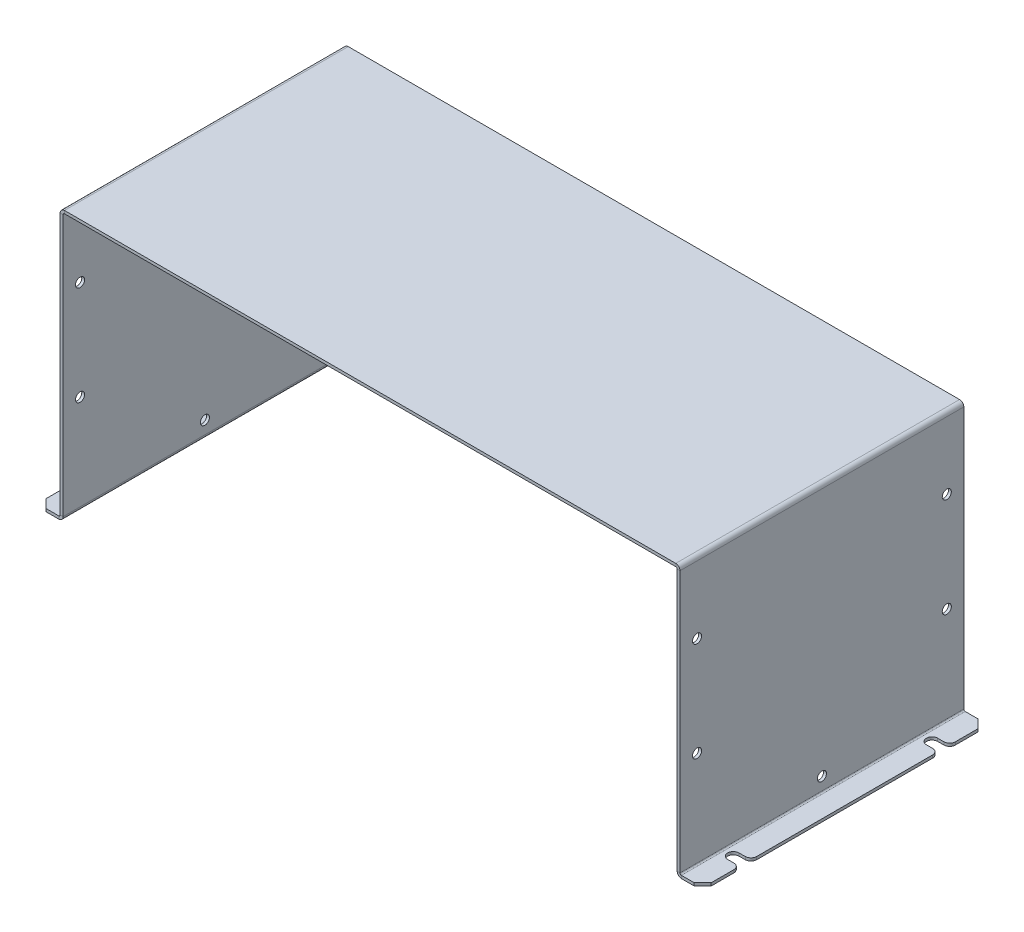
ISO-10303-21;
HEADER;
FILE_DESCRIPTION(('STEP AP214'),'2;1');
FILE_NAME('part.step','',(''),(''),'','','');
FILE_SCHEMA(('AUTOMOTIVE_DESIGN { 1 0 10303 214 1 1 1 1 }'));
ENDSEC;
DATA;
#1=APPLICATION_CONTEXT('core data for automotive mechanical design processes');
#2=APPLICATION_PROTOCOL_DEFINITION('international standard','automotive_design',2000,#1);
#3=PRODUCT_CONTEXT('',#1,'mechanical');
#4=PRODUCT('Part','Part','',(#3));
#5=PRODUCT_RELATED_PRODUCT_CATEGORY('part','',(#4));
#6=PRODUCT_DEFINITION_FORMATION('','',#4);
#7=PRODUCT_DEFINITION_CONTEXT('part definition',#1,'design');
#8=PRODUCT_DEFINITION('design','',#6,#7);
#9=PRODUCT_DEFINITION_SHAPE('','',#8);
#10=(LENGTH_UNIT() NAMED_UNIT(*) SI_UNIT(.MILLI.,.METRE.));
#11=(NAMED_UNIT(*) PLANE_ANGLE_UNIT() SI_UNIT($,.RADIAN.));
#12=(NAMED_UNIT(*) SI_UNIT($,.STERADIAN.) SOLID_ANGLE_UNIT());
#13=UNCERTAINTY_MEASURE_WITH_UNIT(LENGTH_MEASURE(1.E-05),#10,'distance_accuracy_value','');
#14=(GEOMETRIC_REPRESENTATION_CONTEXT(3) GLOBAL_UNCERTAINTY_ASSIGNED_CONTEXT((#13)) GLOBAL_UNIT_ASSIGNED_CONTEXT((#10,
#11,#12)) REPRESENTATION_CONTEXT('',''));
#15=CARTESIAN_POINT('',(0.,0.,0.));
#16=DIRECTION('',(0.,0.,1.));
#17=DIRECTION('',(1.,0.,0.));
#18=AXIS2_PLACEMENT_3D('',#15,#16,#17);
#19=CARTESIAN_POINT('',(117.2,-95.2,50.));
#20=DIRECTION('',(0.,1.,0.));
#21=DIRECTION('',(0.,0.,1.));
#22=AXIS2_PLACEMENT_3D('',#19,#20,#21);
#23=PLANE('',#22);
#24=CARTESIAN_POINT('',(115.2,-95.2,-31.0000000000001));
#25=DIRECTION('',(0.,1.,0.));
#26=DIRECTION('',(0.,0.,1.));
#27=AXIS2_PLACEMENT_3D('',#24,#25,#26);
#28=CIRCLE('',#27,1.99999999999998);
#29=CARTESIAN_POINT('',(117.2,-95.2,-31.0000000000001));
#30=VERTEX_POINT('',#29);
#31=CARTESIAN_POINT('',(115.2,-95.2,-33.));
#32=VERTEX_POINT('',#31);
#33=EDGE_CURVE('E416',#30,#32,#28,.T.);
#34=ORIENTED_EDGE('',*,*,#33,.F.);
#35=DIRECTION('',(0.,0.,1.));
#36=VECTOR('',#35,1.);
#37=CARTESIAN_POINT('',(117.2,-95.2,50.));
#38=LINE('',#37,#36);
#39=CARTESIAN_POINT('',(117.2,-95.2,30.9999999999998));
#40=VERTEX_POINT('',#39);
#41=EDGE_CURVE('E670',#30,#40,#38,.T.);
#42=ORIENTED_EDGE('',*,*,#41,.T.);
#43=CARTESIAN_POINT('',(115.2,-95.2,30.9999999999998));
#44=DIRECTION('',(0.,1.,0.));
#45=DIRECTION('',(0.,0.,1.));
#46=AXIS2_PLACEMENT_3D('',#43,#44,#45);
#47=CIRCLE('',#46,1.99999999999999);
#48=CARTESIAN_POINT('',(115.2,-95.2,32.9999999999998));
#49=VERTEX_POINT('',#48);
#50=EDGE_CURVE('E516',#49,#40,#47,.T.);
#51=ORIENTED_EDGE('',*,*,#50,.F.);
#52=DIRECTION('',(1.,0.,0.));
#53=VECTOR('',#52,1.);
#54=CARTESIAN_POINT('',(113.,-95.2,32.9999999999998));
#55=LINE('',#54,#53);
#56=CARTESIAN_POINT('',(113.,-95.2,32.9999999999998));
#57=VERTEX_POINT('',#56);
#58=EDGE_CURVE('E523',#57,#49,#55,.T.);
#59=ORIENTED_EDGE('',*,*,#58,.F.);
#60=CARTESIAN_POINT('',(113.,-95.2,34.9999999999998));
#61=DIRECTION('',(0.,1.,0.));
#62=DIRECTION('',(0.,0.,1.));
#63=AXIS2_PLACEMENT_3D('',#60,#61,#62);
#64=CIRCLE('',#63,2.);
#65=CARTESIAN_POINT('',(113.,-95.2,36.9999999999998));
#66=VERTEX_POINT('',#65);
#67=EDGE_CURVE('E542',#66,#57,#64,.F.);
#68=ORIENTED_EDGE('',*,*,#67,.F.);
#69=DIRECTION('',(-1.,0.,0.));
#70=VECTOR('',#69,1.);
#71=CARTESIAN_POINT('',(115.2,-95.2,36.9999999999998));
#72=LINE('',#71,#70);
#73=CARTESIAN_POINT('',(115.2,-95.2,36.9999999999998));
#74=VERTEX_POINT('',#73);
#75=EDGE_CURVE('E540',#74,#66,#72,.T.);
#76=ORIENTED_EDGE('',*,*,#75,.F.);
#77=CARTESIAN_POINT('',(115.2,-95.2,38.9999999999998));
#78=DIRECTION('',(0.,1.,0.));
#79=DIRECTION('',(0.,0.,1.));
#80=AXIS2_PLACEMENT_3D('',#77,#78,#79);
#81=CIRCLE('',#80,1.99999999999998);
#82=CARTESIAN_POINT('',(117.2,-95.2,38.9999999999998));
#83=VERTEX_POINT('',#82);
#84=EDGE_CURVE('E538',#83,#74,#81,.T.);
#85=ORIENTED_EDGE('',*,*,#84,.F.);
#86=CARTESIAN_POINT('',(117.2,-95.2,47.));
#87=VERTEX_POINT('',#86);
#88=EDGE_CURVE('E671',#83,#87,#38,.T.);
#89=ORIENTED_EDGE('',*,*,#88,.T.);
#90=DIRECTION('',(0.707106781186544,0.,-0.707106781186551));
#91=VECTOR('',#90,1.);
#92=CARTESIAN_POINT('',(114.2,-95.2,50.));
#93=LINE('',#92,#91);
#94=CARTESIAN_POINT('',(114.2,-95.2,50.));
#95=VERTEX_POINT('',#94);
#96=EDGE_CURVE('E851',#87,#95,#93,.F.);
#97=ORIENTED_EDGE('',*,*,#96,.T.);
#98=DIRECTION('',(-1.,0.,0.));
#99=VECTOR('',#98,1.);
#100=CARTESIAN_POINT('',(117.2,-95.2,50.));
#101=LINE('',#100,#99);
#102=CARTESIAN_POINT('',(109.7,-95.2,50.));
#103=VERTEX_POINT('',#102);
#104=EDGE_CURVE('E675',#95,#103,#101,.T.);
#105=ORIENTED_EDGE('',*,*,#104,.T.);
#106=DIRECTION('',(0.,0.,-1.));
#107=VECTOR('',#106,1.);
#108=CARTESIAN_POINT('',(109.7,-95.2,50.));
#109=LINE('',#108,#107);
#110=CARTESIAN_POINT('',(109.7,-95.2,-50.));
#111=VERTEX_POINT('',#110);
#112=EDGE_CURVE('E686',#111,#103,#109,.F.);
#113=ORIENTED_EDGE('',*,*,#112,.F.);
#114=DIRECTION('',(1.,0.,0.));
#115=VECTOR('',#114,1.);
#116=CARTESIAN_POINT('',(117.2,-95.2,-50.));
#117=LINE('',#116,#115);
#118=CARTESIAN_POINT('',(114.2,-95.2,-50.));
#119=VERTEX_POINT('',#118);
#120=EDGE_CURVE('E672',#111,#119,#117,.T.);
#121=ORIENTED_EDGE('',*,*,#120,.T.);
#122=DIRECTION('',(-0.707106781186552,0.,-0.707106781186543));
#123=VECTOR('',#122,1.);
#124=CARTESIAN_POINT('',(117.2,-95.2,-47.));
#125=LINE('',#124,#123);
#126=CARTESIAN_POINT('',(117.2,-95.2,-47.));
#127=VERTEX_POINT('',#126);
#128=EDGE_CURVE('E84',#119,#127,#125,.F.);
#129=ORIENTED_EDGE('',*,*,#128,.T.);
#130=CARTESIAN_POINT('',(117.2,-95.2,-39.));
#131=VERTEX_POINT('',#130);
#132=EDGE_CURVE('E666',#127,#131,#38,.T.);
#133=ORIENTED_EDGE('',*,*,#132,.T.);
#134=CARTESIAN_POINT('',(115.2,-95.2,-39.));
#135=DIRECTION('',(0.,1.,0.));
#136=DIRECTION('',(0.,0.,1.));
#137=AXIS2_PLACEMENT_3D('',#134,#135,#136);
#138=CIRCLE('',#137,1.99999999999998);
#139=CARTESIAN_POINT('',(115.2,-95.2,-37.));
#140=VERTEX_POINT('',#139);
#141=EDGE_CURVE('E92',#140,#131,#138,.T.);
#142=ORIENTED_EDGE('',*,*,#141,.F.);
#143=DIRECTION('',(1.,0.,0.));
#144=VECTOR('',#143,1.);
#145=CARTESIAN_POINT('',(115.2,-95.2,-37.));
#146=LINE('',#145,#144);
#147=CARTESIAN_POINT('',(113.,-95.2,-37.));
#148=VERTEX_POINT('',#147);
#149=EDGE_CURVE('E392',#148,#140,#146,.T.);
#150=ORIENTED_EDGE('',*,*,#149,.F.);
#151=CARTESIAN_POINT('',(113.,-95.2,-35.));
#152=DIRECTION('',(0.,1.,0.));
#153=DIRECTION('',(0.,0.,1.));
#154=AXIS2_PLACEMENT_3D('',#151,#152,#153);
#155=CIRCLE('',#154,2.);
#156=CARTESIAN_POINT('',(113.,-95.2,-33.));
#157=VERTEX_POINT('',#156);
#158=EDGE_CURVE('E420',#157,#148,#155,.F.);
#159=ORIENTED_EDGE('',*,*,#158,.F.);
#160=DIRECTION('',(-1.,0.,0.));
#161=VECTOR('',#160,1.);
#162=CARTESIAN_POINT('',(113.,-95.2,-33.));
#163=LINE('',#162,#161);
#164=EDGE_CURVE('E418',#32,#157,#163,.T.);
#165=ORIENTED_EDGE('',*,*,#164,.F.);
#166=EDGE_LOOP('',(#34,#42,#51,#59,#68,#76,#85,#89,#97,#105,#113,#121,#129,#133,#142,#150,#159,#165));
#167=FACE_BOUND('',#166,.T.);
#168=ADVANCED_FACE('F75',(#167),#23,.F.);
#169=CARTESIAN_POINT('',(117.2,-94.2,50.));
#170=DIRECTION('',(0.,1.,0.));
#171=DIRECTION('',(0.,0.,1.));
#172=AXIS2_PLACEMENT_3D('',#169,#170,#171);
#173=PLANE('',#172);
#174=DIRECTION('',(0.,0.,-1.));
#175=VECTOR('',#174,1.);
#176=CARTESIAN_POINT('',(117.2,-94.2,50.));
#177=LINE('',#176,#175);
#178=CARTESIAN_POINT('',(117.2,-94.2,-31.0000000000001));
#179=VERTEX_POINT('',#178);
#180=CARTESIAN_POINT('',(117.2,-94.2,30.9999999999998));
#181=VERTEX_POINT('',#180);
#182=EDGE_CURVE('E679',#179,#181,#177,.F.);
#183=ORIENTED_EDGE('',*,*,#182,.F.);
#184=CARTESIAN_POINT('',(115.2,-94.2,-31.0000000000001));
#185=DIRECTION('',(0.,1.,0.));
#186=DIRECTION('',(0.,0.,1.));
#187=AXIS2_PLACEMENT_3D('',#184,#185,#186);
#188=CIRCLE('',#187,1.99999999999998);
#189=CARTESIAN_POINT('',(115.2,-94.2,-33.));
#190=VERTEX_POINT('',#189);
#191=EDGE_CURVE('E391',#179,#190,#188,.T.);
#192=ORIENTED_EDGE('',*,*,#191,.T.);
#193=DIRECTION('',(1.,0.,0.));
#194=VECTOR('',#193,1.);
#195=CARTESIAN_POINT('',(117.2,-94.2,-33.));
#196=LINE('',#195,#194);
#197=CARTESIAN_POINT('',(113.,-94.2,-33.));
#198=VERTEX_POINT('',#197);
#199=EDGE_CURVE('E409',#190,#198,#196,.F.);
#200=ORIENTED_EDGE('',*,*,#199,.T.);
#201=CARTESIAN_POINT('',(113.,-94.2,-35.));
#202=DIRECTION('',(0.,1.,0.));
#203=DIRECTION('',(0.,0.,1.));
#204=AXIS2_PLACEMENT_3D('',#201,#202,#203);
#205=CIRCLE('',#204,2.);
#206=CARTESIAN_POINT('',(113.,-94.2,-37.));
#207=VERTEX_POINT('',#206);
#208=EDGE_CURVE('E406',#198,#207,#205,.F.);
#209=ORIENTED_EDGE('',*,*,#208,.T.);
#210=DIRECTION('',(1.,0.,0.));
#211=VECTOR('',#210,1.);
#212=CARTESIAN_POINT('',(117.2,-94.2,-37.));
#213=LINE('',#212,#211);
#214=CARTESIAN_POINT('',(115.2,-94.2,-37.));
#215=VERTEX_POINT('',#214);
#216=EDGE_CURVE('E397',#207,#215,#213,.T.);
#217=ORIENTED_EDGE('',*,*,#216,.T.);
#218=CARTESIAN_POINT('',(115.2,-94.2,-39.));
#219=DIRECTION('',(0.,1.,0.));
#220=DIRECTION('',(0.,0.,1.));
#221=AXIS2_PLACEMENT_3D('',#218,#219,#220);
#222=CIRCLE('',#221,1.99999999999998);
#223=CARTESIAN_POINT('',(117.2,-94.2,-39.));
#224=VERTEX_POINT('',#223);
#225=EDGE_CURVE('E382',#215,#224,#222,.T.);
#226=ORIENTED_EDGE('',*,*,#225,.T.);
#227=CARTESIAN_POINT('',(117.2,-94.2,-47.));
#228=VERTEX_POINT('',#227);
#229=EDGE_CURVE('E677',#228,#224,#177,.F.);
#230=ORIENTED_EDGE('',*,*,#229,.F.);
#231=DIRECTION('',(0.707106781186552,0.,0.707106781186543));
#232=VECTOR('',#231,1.);
#233=CARTESIAN_POINT('',(165.7,-94.2,1.4999999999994));
#234=LINE('',#233,#232);
#235=CARTESIAN_POINT('',(114.2,-94.2,-50.));
#236=VERTEX_POINT('',#235);
#237=EDGE_CURVE('E847',#228,#236,#234,.F.);
#238=ORIENTED_EDGE('',*,*,#237,.T.);
#239=DIRECTION('',(-1.,0.,0.));
#240=VECTOR('',#239,1.);
#241=CARTESIAN_POINT('',(117.2,-94.2,-50.));
#242=LINE('',#241,#240);
#243=CARTESIAN_POINT('',(109.7,-94.2,-50.));
#244=VERTEX_POINT('',#243);
#245=EDGE_CURVE('E681',#244,#236,#242,.F.);
#246=ORIENTED_EDGE('',*,*,#245,.F.);
#247=DIRECTION('',(0.,0.,-1.));
#248=VECTOR('',#247,1.);
#249=CARTESIAN_POINT('',(109.7,-94.2,50.));
#250=LINE('',#249,#248);
#251=CARTESIAN_POINT('',(109.7,-94.2,50.));
#252=VERTEX_POINT('',#251);
#253=EDGE_CURVE('E692',#252,#244,#250,.T.);
#254=ORIENTED_EDGE('',*,*,#253,.F.);
#255=DIRECTION('',(1.,0.,0.));
#256=VECTOR('',#255,1.);
#257=CARTESIAN_POINT('',(109.2,-94.2,50.));
#258=LINE('',#257,#256);
#259=CARTESIAN_POINT('',(114.2,-94.2,50.));
#260=VERTEX_POINT('',#259);
#261=EDGE_CURVE('E684',#260,#252,#258,.F.);
#262=ORIENTED_EDGE('',*,*,#261,.F.);
#263=DIRECTION('',(-0.707106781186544,0.,0.707106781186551));
#264=VECTOR('',#263,1.);
#265=CARTESIAN_POINT('',(115.7,-94.2,48.5));
#266=LINE('',#265,#264);
#267=CARTESIAN_POINT('',(117.2,-94.2,47.));
#268=VERTEX_POINT('',#267);
#269=EDGE_CURVE('E844',#260,#268,#266,.F.);
#270=ORIENTED_EDGE('',*,*,#269,.T.);
#271=CARTESIAN_POINT('',(117.2,-94.2,38.9999999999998));
#272=VERTEX_POINT('',#271);
#273=EDGE_CURVE('E680',#272,#268,#177,.F.);
#274=ORIENTED_EDGE('',*,*,#273,.F.);
#275=CARTESIAN_POINT('',(115.2,-94.2,38.9999999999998));
#276=DIRECTION('',(0.,1.,0.));
#277=DIRECTION('',(0.,0.,1.));
#278=AXIS2_PLACEMENT_3D('',#275,#276,#277);
#279=CIRCLE('',#278,1.99999999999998);
#280=CARTESIAN_POINT('',(115.2,-94.2,36.9999999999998));
#281=VERTEX_POINT('',#280);
#282=EDGE_CURVE('E522',#272,#281,#279,.T.);
#283=ORIENTED_EDGE('',*,*,#282,.T.);
#284=DIRECTION('',(1.,0.,0.));
#285=VECTOR('',#284,1.);
#286=CARTESIAN_POINT('',(117.2,-94.2,36.9999999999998));
#287=LINE('',#286,#285);
#288=CARTESIAN_POINT('',(113.,-94.2,36.9999999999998));
#289=VERTEX_POINT('',#288);
#290=EDGE_CURVE('E531',#281,#289,#287,.F.);
#291=ORIENTED_EDGE('',*,*,#290,.T.);
#292=CARTESIAN_POINT('',(113.,-94.2,34.9999999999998));
#293=DIRECTION('',(0.,1.,0.));
#294=DIRECTION('',(0.,0.,1.));
#295=AXIS2_PLACEMENT_3D('',#292,#293,#294);
#296=CIRCLE('',#295,2.);
#297=CARTESIAN_POINT('',(113.,-94.2,32.9999999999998));
#298=VERTEX_POINT('',#297);
#299=EDGE_CURVE('E528',#289,#298,#296,.F.);
#300=ORIENTED_EDGE('',*,*,#299,.T.);
#301=DIRECTION('',(1.,0.,0.));
#302=VECTOR('',#301,1.);
#303=CARTESIAN_POINT('',(117.2,-94.2,32.9999999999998));
#304=LINE('',#303,#302);
#305=CARTESIAN_POINT('',(115.2,-94.2,32.9999999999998));
#306=VERTEX_POINT('',#305);
#307=EDGE_CURVE('E524',#298,#306,#304,.T.);
#308=ORIENTED_EDGE('',*,*,#307,.T.);
#309=CARTESIAN_POINT('',(115.2,-94.2,30.9999999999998));
#310=DIRECTION('',(0.,1.,0.));
#311=DIRECTION('',(0.,0.,1.));
#312=AXIS2_PLACEMENT_3D('',#309,#310,#311);
#313=CIRCLE('',#312,1.99999999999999);
#314=EDGE_CURVE('E519',#306,#181,#313,.T.);
#315=ORIENTED_EDGE('',*,*,#314,.T.);
#316=EDGE_LOOP('',(#183,#192,#200,#209,#217,#226,#230,#238,#246,#254,#262,#270,#274,#283,#291,
#300,#308,#315));
#317=FACE_BOUND('',#316,.T.);
#318=ADVANCED_FACE('F404',(#317),#173,.T.);
#319=CARTESIAN_POINT('',(117.2,-95.2,50.));
#320=DIRECTION('',(-1.,0.,0.));
#321=DIRECTION('',(0.,-1.,0.));
#322=AXIS2_PLACEMENT_3D('',#319,#320,#321);
#323=PLANE('',#322);
#324=DIRECTION('',(0.,-1.,0.));
#325=VECTOR('',#324,1.);
#326=CARTESIAN_POINT('',(117.2,-95.2,-39.));
#327=LINE('',#326,#325);
#328=EDGE_CURVE('E386',#131,#224,#327,.F.);
#329=ORIENTED_EDGE('',*,*,#328,.F.);
#330=ORIENTED_EDGE('',*,*,#132,.F.);
#331=DIRECTION('',(0.,1.,0.));
#332=VECTOR('',#331,1.);
#333=CARTESIAN_POINT('',(117.2,-95.2,-47.));
#334=LINE('',#333,#332);
#335=EDGE_CURVE('E841',#127,#228,#334,.T.);
#336=ORIENTED_EDGE('',*,*,#335,.T.);
#337=ORIENTED_EDGE('',*,*,#229,.T.);
#338=EDGE_LOOP('',(#329,#330,#336,#337));
#339=FACE_BOUND('',#338,.T.);
#340=ADVANCED_FACE('F939',(#339),#323,.F.);
#341=CARTESIAN_POINT('',(-117.2,-95.2,-50.));
#342=DIRECTION('',(0.,1.,0.));
#343=DIRECTION('',(0.,0.,1.));
#344=AXIS2_PLACEMENT_3D('',#341,#342,#343);
#345=PLANE('',#344);
#346=CARTESIAN_POINT('',(-115.2,-95.2,30.9999999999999));
#347=DIRECTION('',(0.,1.,0.));
#348=DIRECTION('',(0.,0.,1.));
#349=AXIS2_PLACEMENT_3D('',#346,#347,#348);
#350=CIRCLE('',#349,1.99999999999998);
#351=CARTESIAN_POINT('',(-117.2,-95.2,30.9999999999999));
#352=VERTEX_POINT('',#351);
#353=CARTESIAN_POINT('',(-115.2,-95.2,32.9999999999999));
#354=VERTEX_POINT('',#353);
#355=EDGE_CURVE('E451',#352,#354,#350,.T.);
#356=ORIENTED_EDGE('',*,*,#355,.F.);
#357=DIRECTION('',(0.,0.,-1.));
#358=VECTOR('',#357,1.);
#359=CARTESIAN_POINT('',(-117.2,-95.2,-50.));
#360=LINE('',#359,#358);
#361=CARTESIAN_POINT('',(-117.2,-95.2,-31.));
#362=VERTEX_POINT('',#361);
#363=EDGE_CURVE('E616',#352,#362,#360,.T.);
#364=ORIENTED_EDGE('',*,*,#363,.T.);
#365=CARTESIAN_POINT('',(-115.2,-95.2,-31.));
#366=DIRECTION('',(0.,1.,0.));
#367=DIRECTION('',(0.,0.,1.));
#368=AXIS2_PLACEMENT_3D('',#365,#366,#367);
#369=CIRCLE('',#368,1.99999999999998);
#370=CARTESIAN_POINT('',(-115.2,-95.2,-32.9999999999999));
#371=VERTEX_POINT('',#370);
#372=EDGE_CURVE('E473',#371,#362,#369,.T.);
#373=ORIENTED_EDGE('',*,*,#372,.F.);
#374=DIRECTION('',(-1.,0.,0.));
#375=VECTOR('',#374,1.);
#376=CARTESIAN_POINT('',(-113.,-95.2,-32.9999999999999));
#377=LINE('',#376,#375);
#378=CARTESIAN_POINT('',(-113.,-95.2,-32.9999999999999));
#379=VERTEX_POINT('',#378);
#380=EDGE_CURVE('E479',#379,#371,#377,.T.);
#381=ORIENTED_EDGE('',*,*,#380,.F.);
#382=CARTESIAN_POINT('',(-113.,-95.2,-34.9999999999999));
#383=DIRECTION('',(0.,1.,0.));
#384=DIRECTION('',(0.,0.,1.));
#385=AXIS2_PLACEMENT_3D('',#382,#383,#384);
#386=CIRCLE('',#385,2.);
#387=CARTESIAN_POINT('',(-113.,-95.2,-36.9999999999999));
#388=VERTEX_POINT('',#387);
#389=EDGE_CURVE('E498',#388,#379,#386,.F.);
#390=ORIENTED_EDGE('',*,*,#389,.F.);
#391=DIRECTION('',(1.,0.,0.));
#392=VECTOR('',#391,1.);
#393=CARTESIAN_POINT('',(-115.2,-95.2,-36.9999999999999));
#394=LINE('',#393,#392);
#395=CARTESIAN_POINT('',(-115.2,-95.2,-36.9999999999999));
#396=VERTEX_POINT('',#395);
#397=EDGE_CURVE('E496',#396,#388,#394,.T.);
#398=ORIENTED_EDGE('',*,*,#397,.F.);
#399=CARTESIAN_POINT('',(-115.2,-95.2,-38.9999999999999));
#400=DIRECTION('',(0.,1.,0.));
#401=DIRECTION('',(0.,0.,1.));
#402=AXIS2_PLACEMENT_3D('',#399,#400,#401);
#403=CIRCLE('',#402,1.99999999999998);
#404=CARTESIAN_POINT('',(-117.2,-95.2,-38.9999999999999));
#405=VERTEX_POINT('',#404);
#406=EDGE_CURVE('E494',#405,#396,#403,.T.);
#407=ORIENTED_EDGE('',*,*,#406,.F.);
#408=CARTESIAN_POINT('',(-117.2,-95.2,-46.9999999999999));
#409=VERTEX_POINT('',#408);
#410=EDGE_CURVE('E617',#405,#409,#360,.T.);
#411=ORIENTED_EDGE('',*,*,#410,.T.);
#412=DIRECTION('',(-0.707106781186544,0.,0.707106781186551));
#413=VECTOR('',#412,1.);
#414=CARTESIAN_POINT('',(-114.2,-95.2,-50.));
#415=LINE('',#414,#413);
#416=CARTESIAN_POINT('',(-114.2,-95.2,-50.));
#417=VERTEX_POINT('',#416);
#418=EDGE_CURVE('E831',#409,#417,#415,.F.);
#419=ORIENTED_EDGE('',*,*,#418,.T.);
#420=DIRECTION('',(1.,0.,0.));
#421=VECTOR('',#420,1.);
#422=CARTESIAN_POINT('',(-117.2,-95.2,-50.));
#423=LINE('',#422,#421);
#424=CARTESIAN_POINT('',(-109.7,-95.2,-50.));
#425=VERTEX_POINT('',#424);
#426=EDGE_CURVE('E621',#417,#425,#423,.T.);
#427=ORIENTED_EDGE('',*,*,#426,.T.);
#428=DIRECTION('',(0.,0.,1.));
#429=VECTOR('',#428,1.);
#430=CARTESIAN_POINT('',(-109.7,-95.2,-50.));
#431=LINE('',#430,#429);
#432=CARTESIAN_POINT('',(-109.7,-95.2,50.));
#433=VERTEX_POINT('',#432);
#434=EDGE_CURVE('E633',#433,#425,#431,.F.);
#435=ORIENTED_EDGE('',*,*,#434,.F.);
#436=DIRECTION('',(-1.,0.,0.));
#437=VECTOR('',#436,1.);
#438=CARTESIAN_POINT('',(-117.2,-95.2,50.));
#439=LINE('',#438,#437);
#440=CARTESIAN_POINT('',(-114.2,-95.2,50.));
#441=VERTEX_POINT('',#440);
#442=EDGE_CURVE('E618',#433,#441,#439,.T.);
#443=ORIENTED_EDGE('',*,*,#442,.T.);
#444=DIRECTION('',(0.707106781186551,0.,0.707106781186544));
#445=VECTOR('',#444,1.);
#446=CARTESIAN_POINT('',(-117.2,-95.2,47.));
#447=LINE('',#446,#445);
#448=CARTESIAN_POINT('',(-117.2,-95.2,47.));
#449=VERTEX_POINT('',#448);
#450=EDGE_CURVE('E833',#441,#449,#447,.F.);
#451=ORIENTED_EDGE('',*,*,#450,.T.);
#452=CARTESIAN_POINT('',(-117.2,-95.2,38.9999999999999));
#453=VERTEX_POINT('',#452);
#454=EDGE_CURVE('E612',#449,#453,#360,.T.);
#455=ORIENTED_EDGE('',*,*,#454,.T.);
#456=CARTESIAN_POINT('',(-115.2,-95.2,38.9999999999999));
#457=DIRECTION('',(0.,1.,0.));
#458=DIRECTION('',(0.,0.,1.));
#459=AXIS2_PLACEMENT_3D('',#456,#457,#458);
#460=CIRCLE('',#459,1.99999999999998);
#461=CARTESIAN_POINT('',(-115.2,-95.2,36.9999999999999));
#462=VERTEX_POINT('',#461);
#463=EDGE_CURVE('E100',#462,#453,#460,.T.);
#464=ORIENTED_EDGE('',*,*,#463,.F.);
#465=DIRECTION('',(-1.,0.,0.));
#466=VECTOR('',#465,1.);
#467=CARTESIAN_POINT('',(-115.2,-95.2,36.9999999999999));
#468=LINE('',#467,#466);
#469=CARTESIAN_POINT('',(-113.,-95.2,36.9999999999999));
#470=VERTEX_POINT('',#469);
#471=EDGE_CURVE('E437',#470,#462,#468,.T.);
#472=ORIENTED_EDGE('',*,*,#471,.F.);
#473=CARTESIAN_POINT('',(-113.,-95.2,34.9999999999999));
#474=DIRECTION('',(0.,1.,0.));
#475=DIRECTION('',(0.,0.,1.));
#476=AXIS2_PLACEMENT_3D('',#473,#474,#475);
#477=CIRCLE('',#476,2.);
#478=CARTESIAN_POINT('',(-113.,-95.2,32.9999999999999));
#479=VERTEX_POINT('',#478);
#480=EDGE_CURVE('E455',#479,#470,#477,.F.);
#481=ORIENTED_EDGE('',*,*,#480,.F.);
#482=DIRECTION('',(1.,0.,0.));
#483=VECTOR('',#482,1.);
#484=CARTESIAN_POINT('',(-113.,-95.2,32.9999999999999));
#485=LINE('',#484,#483);
#486=EDGE_CURVE('E453',#354,#479,#485,.T.);
#487=ORIENTED_EDGE('',*,*,#486,.F.);
#488=EDGE_LOOP('',(#356,#364,#373,#381,#390,#398,#407,#411,#419,#427,#435,#443,#451,#455,#464,
#472,#481,#487));
#489=FACE_BOUND('',#488,.T.);
#490=ADVANCED_FACE('F941',(#489),#345,.F.);
#491=CARTESIAN_POINT('',(-117.2,-94.2,-50.));
#492=DIRECTION('',(0.,1.,0.));
#493=DIRECTION('',(0.,0.,1.));
#494=AXIS2_PLACEMENT_3D('',#491,#492,#493);
#495=PLANE('',#494);
#496=DIRECTION('',(0.,0.,1.));
#497=VECTOR('',#496,1.);
#498=CARTESIAN_POINT('',(-117.2,-94.2,-50.));
#499=LINE('',#498,#497);
#500=CARTESIAN_POINT('',(-117.2,-94.2,30.9999999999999));
#501=VERTEX_POINT('',#500);
#502=CARTESIAN_POINT('',(-117.2,-94.2,-30.9999999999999));
#503=VERTEX_POINT('',#502);
#504=EDGE_CURVE('E626',#501,#503,#499,.F.);
#505=ORIENTED_EDGE('',*,*,#504,.F.);
#506=CARTESIAN_POINT('',(-115.2,-94.2,30.9999999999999));
#507=DIRECTION('',(0.,1.,0.));
#508=DIRECTION('',(0.,0.,1.));
#509=AXIS2_PLACEMENT_3D('',#506,#507,#508);
#510=CIRCLE('',#509,1.99999999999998);
#511=CARTESIAN_POINT('',(-115.2,-94.2,32.9999999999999));
#512=VERTEX_POINT('',#511);
#513=EDGE_CURVE('E436',#501,#512,#510,.T.);
#514=ORIENTED_EDGE('',*,*,#513,.T.);
#515=DIRECTION('',(1.,0.,0.));
#516=VECTOR('',#515,1.);
#517=CARTESIAN_POINT('',(-117.2,-94.2,32.9999999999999));
#518=LINE('',#517,#516);
#519=CARTESIAN_POINT('',(-113.,-94.2,32.9999999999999));
#520=VERTEX_POINT('',#519);
#521=EDGE_CURVE('E445',#512,#520,#518,.T.);
#522=ORIENTED_EDGE('',*,*,#521,.T.);
#523=CARTESIAN_POINT('',(-113.,-94.2,34.9999999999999));
#524=DIRECTION('',(0.,1.,0.));
#525=DIRECTION('',(0.,0.,1.));
#526=AXIS2_PLACEMENT_3D('',#523,#524,#525);
#527=CIRCLE('',#526,2.);
#528=CARTESIAN_POINT('',(-113.,-94.2,36.9999999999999));
#529=VERTEX_POINT('',#528);
#530=EDGE_CURVE('E442',#520,#529,#527,.F.);
#531=ORIENTED_EDGE('',*,*,#530,.T.);
#532=DIRECTION('',(1.,0.,0.));
#533=VECTOR('',#532,1.);
#534=CARTESIAN_POINT('',(-117.2,-94.2,36.9999999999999));
#535=LINE('',#534,#533);
#536=CARTESIAN_POINT('',(-115.2,-94.2,36.9999999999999));
#537=VERTEX_POINT('',#536);
#538=EDGE_CURVE('E438',#529,#537,#535,.F.);
#539=ORIENTED_EDGE('',*,*,#538,.T.);
#540=CARTESIAN_POINT('',(-115.2,-94.2,38.9999999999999));
#541=DIRECTION('',(0.,1.,0.));
#542=DIRECTION('',(0.,0.,1.));
#543=AXIS2_PLACEMENT_3D('',#540,#541,#542);
#544=CIRCLE('',#543,1.99999999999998);
#545=CARTESIAN_POINT('',(-117.2,-94.2,38.9999999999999));
#546=VERTEX_POINT('',#545);
#547=EDGE_CURVE('E433',#537,#546,#544,.T.);
#548=ORIENTED_EDGE('',*,*,#547,.T.);
#549=CARTESIAN_POINT('',(-117.2,-94.2,47.));
#550=VERTEX_POINT('',#549);
#551=EDGE_CURVE('E623',#550,#546,#499,.F.);
#552=ORIENTED_EDGE('',*,*,#551,.F.);
#553=DIRECTION('',(-0.707106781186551,0.,-0.707106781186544));
#554=VECTOR('',#553,1.);
#555=CARTESIAN_POINT('',(-165.7,-94.2,-1.49999999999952));
#556=LINE('',#555,#554);
#557=CARTESIAN_POINT('',(-114.2,-94.2,50.));
#558=VERTEX_POINT('',#557);
#559=EDGE_CURVE('E827',#550,#558,#556,.F.);
#560=ORIENTED_EDGE('',*,*,#559,.T.);
#561=DIRECTION('',(1.,0.,0.));
#562=VECTOR('',#561,1.);
#563=CARTESIAN_POINT('',(-117.2,-94.2,50.));
#564=LINE('',#563,#562);
#565=CARTESIAN_POINT('',(-109.7,-94.2,50.));
#566=VERTEX_POINT('',#565);
#567=EDGE_CURVE('E628',#566,#558,#564,.F.);
#568=ORIENTED_EDGE('',*,*,#567,.F.);
#569=DIRECTION('',(0.,0.,1.));
#570=VECTOR('',#569,1.);
#571=CARTESIAN_POINT('',(-109.7,-94.2,-50.));
#572=LINE('',#571,#570);
#573=CARTESIAN_POINT('',(-109.7,-94.2,-50.));
#574=VERTEX_POINT('',#573);
#575=EDGE_CURVE('E639',#574,#566,#572,.T.);
#576=ORIENTED_EDGE('',*,*,#575,.F.);
#577=DIRECTION('',(-1.,0.,0.));
#578=VECTOR('',#577,1.);
#579=CARTESIAN_POINT('',(-109.2,-94.2,-50.));
#580=LINE('',#579,#578);
#581=CARTESIAN_POINT('',(-114.2,-94.2,-50.));
#582=VERTEX_POINT('',#581);
#583=EDGE_CURVE('E631',#582,#574,#580,.F.);
#584=ORIENTED_EDGE('',*,*,#583,.F.);
#585=DIRECTION('',(0.707106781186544,0.,-0.707106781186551));
#586=VECTOR('',#585,1.);
#587=CARTESIAN_POINT('',(-115.7,-94.2,-48.5));
#588=LINE('',#587,#586);
#589=CARTESIAN_POINT('',(-117.2,-94.2,-46.9999999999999));
#590=VERTEX_POINT('',#589);
#591=EDGE_CURVE('E824',#582,#590,#588,.F.);
#592=ORIENTED_EDGE('',*,*,#591,.T.);
#593=CARTESIAN_POINT('',(-117.2,-94.2,-38.9999999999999));
#594=VERTEX_POINT('',#593);
#595=EDGE_CURVE('E627',#594,#590,#499,.F.);
#596=ORIENTED_EDGE('',*,*,#595,.F.);
#597=CARTESIAN_POINT('',(-115.2,-94.2,-38.9999999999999));
#598=DIRECTION('',(0.,1.,0.));
#599=DIRECTION('',(0.,0.,1.));
#600=AXIS2_PLACEMENT_3D('',#597,#598,#599);
#601=CIRCLE('',#600,1.99999999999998);
#602=CARTESIAN_POINT('',(-115.2,-94.2,-36.9999999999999));
#603=VERTEX_POINT('',#602);
#604=EDGE_CURVE('E478',#594,#603,#601,.T.);
#605=ORIENTED_EDGE('',*,*,#604,.T.);
#606=DIRECTION('',(1.,0.,0.));
#607=VECTOR('',#606,1.);
#608=CARTESIAN_POINT('',(-117.2,-94.2,-36.9999999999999));
#609=LINE('',#608,#607);
#610=CARTESIAN_POINT('',(-113.,-94.2,-36.9999999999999));
#611=VERTEX_POINT('',#610);
#612=EDGE_CURVE('E487',#603,#611,#609,.T.);
#613=ORIENTED_EDGE('',*,*,#612,.T.);
#614=CARTESIAN_POINT('',(-113.,-94.2,-34.9999999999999));
#615=DIRECTION('',(0.,1.,0.));
#616=DIRECTION('',(0.,0.,1.));
#617=AXIS2_PLACEMENT_3D('',#614,#615,#616);
#618=CIRCLE('',#617,2.);
#619=CARTESIAN_POINT('',(-113.,-94.2,-32.9999999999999));
#620=VERTEX_POINT('',#619);
#621=EDGE_CURVE('E484',#611,#620,#618,.F.);
#622=ORIENTED_EDGE('',*,*,#621,.T.);
#623=DIRECTION('',(1.,0.,0.));
#624=VECTOR('',#623,1.);
#625=CARTESIAN_POINT('',(-117.2,-94.2,-32.9999999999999));
#626=LINE('',#625,#624);
#627=CARTESIAN_POINT('',(-115.2,-94.2,-32.9999999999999));
#628=VERTEX_POINT('',#627);
#629=EDGE_CURVE('E480',#620,#628,#626,.F.);
#630=ORIENTED_EDGE('',*,*,#629,.T.);
#631=CARTESIAN_POINT('',(-115.2,-94.2,-31.));
#632=DIRECTION('',(0.,1.,0.));
#633=DIRECTION('',(0.,0.,1.));
#634=AXIS2_PLACEMENT_3D('',#631,#632,#633);
#635=CIRCLE('',#634,1.99999999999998);
#636=EDGE_CURVE('E475',#628,#503,#635,.T.);
#637=ORIENTED_EDGE('',*,*,#636,.T.);
#638=EDGE_LOOP('',(#505,#514,#522,#531,#539,#548,#552,#560,#568,#576,#584,#592,#596,#605,#613,
#622,#630,#637));
#639=FACE_BOUND('',#638,.T.);
#640=ADVANCED_FACE('F949',(#639),#495,.T.);
#641=CARTESIAN_POINT('',(-117.2,-95.2,-50.));
#642=DIRECTION('',(1.,0.,0.));
#643=DIRECTION('',(0.,1.,0.));
#644=AXIS2_PLACEMENT_3D('',#641,#642,#643);
#645=PLANE('',#644);
#646=DIRECTION('',(0.,-1.,0.));
#647=VECTOR('',#646,1.);
#648=CARTESIAN_POINT('',(-117.2,-95.2,38.9999999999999));
#649=LINE('',#648,#647);
#650=EDGE_CURVE('E441',#453,#546,#649,.F.);
#651=ORIENTED_EDGE('',*,*,#650,.F.);
#652=ORIENTED_EDGE('',*,*,#454,.F.);
#653=DIRECTION('',(0.,1.,0.));
#654=VECTOR('',#653,1.);
#655=CARTESIAN_POINT('',(-117.2,-95.2,47.));
#656=LINE('',#655,#654);
#657=EDGE_CURVE('E821',#449,#550,#656,.T.);
#658=ORIENTED_EDGE('',*,*,#657,.T.);
#659=ORIENTED_EDGE('',*,*,#551,.T.);
#660=EDGE_LOOP('',(#651,#652,#658,#659));
#661=FACE_BOUND('',#660,.T.);
#662=ADVANCED_FACE('F995',(#661),#645,.F.);
#663=ORIENTED_EDGE('',*,*,#363,.F.);
#664=DIRECTION('',(0.,-1.,0.));
#665=VECTOR('',#664,1.);
#666=CARTESIAN_POINT('',(-117.2,-95.2,30.9999999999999));
#667=LINE('',#666,#665);
#668=EDGE_CURVE('E470',#352,#501,#667,.F.);
#669=ORIENTED_EDGE('',*,*,#668,.T.);
#670=ORIENTED_EDGE('',*,*,#504,.T.);
#671=DIRECTION('',(0.,-1.,0.));
#672=VECTOR('',#671,1.);
#673=CARTESIAN_POINT('',(-117.2,-95.2,-30.9999999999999));
#674=LINE('',#673,#672);
#675=EDGE_CURVE('E483',#362,#503,#674,.F.);
#676=ORIENTED_EDGE('',*,*,#675,.F.);
#677=EDGE_LOOP('',(#663,#669,#670,#676));
#678=FACE_BOUND('',#677,.T.);
#679=ADVANCED_FACE('F956',(#678),#645,.F.);
#680=ORIENTED_EDGE('',*,*,#41,.F.);
#681=DIRECTION('',(0.,-1.,0.));
#682=VECTOR('',#681,1.);
#683=CARTESIAN_POINT('',(117.2,-95.2,-31.0000000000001));
#684=LINE('',#683,#682);
#685=EDGE_CURVE('E430',#30,#179,#684,.F.);
#686=ORIENTED_EDGE('',*,*,#685,.T.);
#687=ORIENTED_EDGE('',*,*,#182,.T.);
#688=DIRECTION('',(0.,-1.,0.));
#689=VECTOR('',#688,1.);
#690=CARTESIAN_POINT('',(117.2,-95.2,30.9999999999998));
#691=LINE('',#690,#689);
#692=EDGE_CURVE('E527',#40,#181,#691,.F.);
#693=ORIENTED_EDGE('',*,*,#692,.F.);
#694=EDGE_LOOP('',(#680,#686,#687,#693));
#695=FACE_BOUND('',#694,.T.);
#696=ADVANCED_FACE('F943',(#695),#323,.F.);
#697=CARTESIAN_POINT('',(-109.2,-95.2,-50.));
#698=DIRECTION('',(0.,0.,1.));
#699=DIRECTION('',(0.,-1.,0.));
#700=AXIS2_PLACEMENT_3D('',#697,#698,#699);
#701=PLANE('',#700);
#702=DIRECTION('',(1.,0.,0.));
#703=VECTOR('',#702,1.);
#704=CARTESIAN_POINT('',(-109.2,-93.7,-50.));
#705=LINE('',#704,#703);
#706=CARTESIAN_POINT('',(-109.2,-93.7,-50.));
#707=VERTEX_POINT('',#706);
#708=CARTESIAN_POINT('',(-108.2,-93.7,-50.));
#709=VERTEX_POINT('',#708);
#710=EDGE_CURVE('E660',#707,#709,#705,.T.);
#711=ORIENTED_EDGE('',*,*,#710,.F.);
#712=DIRECTION('',(0.,-1.,0.));
#713=VECTOR('',#712,1.);
#714=CARTESIAN_POINT('',(-109.2,-95.2,-50.));
#715=LINE('',#714,#713);
#716=CARTESIAN_POINT('',(-109.2,-1.5,-50.));
#717=VERTEX_POINT('',#716);
#718=EDGE_CURVE('E730',#717,#707,#715,.T.);
#719=ORIENTED_EDGE('',*,*,#718,.F.);
#720=DIRECTION('',(-1.,0.,0.));
#721=VECTOR('',#720,1.);
#722=CARTESIAN_POINT('',(-108.2,-1.5,-50.));
#723=LINE('',#722,#721);
#724=CARTESIAN_POINT('',(-108.2,-1.5,-50.));
#725=VERTEX_POINT('',#724);
#726=EDGE_CURVE('E721',#725,#717,#723,.T.);
#727=ORIENTED_EDGE('',*,*,#726,.F.);
#728=DIRECTION('',(0.,-1.,0.));
#729=VECTOR('',#728,1.);
#730=CARTESIAN_POINT('',(-108.2,-95.2,-50.));
#731=LINE('',#730,#729);
#732=EDGE_CURVE('E729',#725,#709,#731,.T.);
#733=ORIENTED_EDGE('',*,*,#732,.T.);
#734=EDGE_LOOP('',(#711,#719,#727,#733));
#735=FACE_BOUND('',#734,.T.);
#736=ADVANCED_FACE('F955',(#735),#701,.F.);
#737=CARTESIAN_POINT('',(-109.2,-0.999999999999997,50.));
#738=DIRECTION('',(0.,0.,-1.));
#739=DIRECTION('',(-1.,0.,0.));
#740=AXIS2_PLACEMENT_3D('',#737,#738,#739);
#741=PLANE('',#740);
#742=DIRECTION('',(1.,0.,0.));
#743=VECTOR('',#742,1.);
#744=CARTESIAN_POINT('',(-109.2,-93.7,50.));
#745=LINE('',#744,#743);
#746=CARTESIAN_POINT('',(-109.2,-93.7,50.));
#747=VERTEX_POINT('',#746);
#748=CARTESIAN_POINT('',(-108.2,-93.7,50.));
#749=VERTEX_POINT('',#748);
#750=EDGE_CURVE('E650',#747,#749,#745,.T.);
#751=ORIENTED_EDGE('',*,*,#750,.T.);
#752=DIRECTION('',(0.,1.,0.));
#753=VECTOR('',#752,1.);
#754=CARTESIAN_POINT('',(-108.2,-1.,50.));
#755=LINE('',#754,#753);
#756=CARTESIAN_POINT('',(-108.2,-1.5,50.));
#757=VERTEX_POINT('',#756);
#758=EDGE_CURVE('E734',#749,#757,#755,.T.);
#759=ORIENTED_EDGE('',*,*,#758,.T.);
#760=DIRECTION('',(-1.,0.,0.));
#761=VECTOR('',#760,1.);
#762=CARTESIAN_POINT('',(-108.2,-1.5,50.));
#763=LINE('',#762,#761);
#764=CARTESIAN_POINT('',(-109.2,-1.5,50.));
#765=VERTEX_POINT('',#764);
#766=EDGE_CURVE('E716',#757,#765,#763,.T.);
#767=ORIENTED_EDGE('',*,*,#766,.T.);
#768=DIRECTION('',(0.,1.,0.));
#769=VECTOR('',#768,1.);
#770=CARTESIAN_POINT('',(-109.2,-0.999999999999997,50.));
#771=LINE('',#770,#769);
#772=EDGE_CURVE('E733',#747,#765,#771,.T.);
#773=ORIENTED_EDGE('',*,*,#772,.F.);
#774=EDGE_LOOP('',(#751,#759,#767,#773));
#775=FACE_BOUND('',#774,.T.);
#776=ADVANCED_FACE('F1504',(#775),#741,.F.);
#777=CARTESIAN_POINT('',(-109.2,-0.999999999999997,-50.));
#778=DIRECTION('',(1.,0.,0.));
#779=DIRECTION('',(0.,1.,0.));
#780=AXIS2_PLACEMENT_3D('',#777,#778,#779);
#781=PLANE('',#780);
#782=CARTESIAN_POINT('',(-109.2,-25.2000000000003,-43.9999999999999));
#783=DIRECTION('',(1.,0.,0.));
#784=DIRECTION('',(0.,1.,0.));
#785=AXIS2_PLACEMENT_3D('',#782,#783,#784);
#786=CIRCLE('',#785,1.6);
#787=CARTESIAN_POINT('',(-109.2,-23.6000000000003,-43.9999999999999));
#788=VERTEX_POINT('',#787);
#789=EDGE_CURVE('E568',#788,#788,#786,.T.);
#790=ORIENTED_EDGE('',*,*,#789,.T.);
#791=EDGE_LOOP('',(#790));
#792=FACE_BOUND('',#791,.T.);
#793=CARTESIAN_POINT('',(-109.2,-60.2000000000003,-44.));
#794=DIRECTION('',(1.,0.,0.));
#795=DIRECTION('',(0.,1.,0.));
#796=AXIS2_PLACEMENT_3D('',#793,#794,#795);
#797=CIRCLE('',#796,1.6);
#798=CARTESIAN_POINT('',(-109.2,-58.6000000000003,-44.));
#799=VERTEX_POINT('',#798);
#800=EDGE_CURVE('E578',#799,#799,#797,.T.);
#801=ORIENTED_EDGE('',*,*,#800,.T.);
#802=EDGE_LOOP('',(#801));
#803=FACE_BOUND('',#802,.T.);
#804=CARTESIAN_POINT('',(-109.2,-25.2000000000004,43.9999999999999));
#805=DIRECTION('',(1.,0.,0.));
#806=DIRECTION('',(0.,1.,0.));
#807=AXIS2_PLACEMENT_3D('',#804,#805,#806);
#808=CIRCLE('',#807,1.6);
#809=CARTESIAN_POINT('',(-109.2,-23.6000000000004,43.9999999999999));
#810=VERTEX_POINT('',#809);
#811=EDGE_CURVE('E588',#810,#810,#808,.T.);
#812=ORIENTED_EDGE('',*,*,#811,.T.);
#813=EDGE_LOOP('',(#812));
#814=FACE_BOUND('',#813,.T.);
#815=CARTESIAN_POINT('',(-109.2,-60.2000000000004,43.9999999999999));
#816=DIRECTION('',(1.,0.,0.));
#817=DIRECTION('',(0.,1.,0.));
#818=AXIS2_PLACEMENT_3D('',#815,#816,#817);
#819=CIRCLE('',#818,1.6);
#820=CARTESIAN_POINT('',(-109.2,-58.6000000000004,43.9999999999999));
#821=VERTEX_POINT('',#820);
#822=EDGE_CURVE('E598',#821,#821,#819,.T.);
#823=ORIENTED_EDGE('',*,*,#822,.T.);
#824=EDGE_LOOP('',(#823));
#825=FACE_BOUND('',#824,.T.);
#826=CARTESIAN_POINT('',(-109.2,-89.2000000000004,0.));
#827=DIRECTION('',(1.,0.,0.));
#828=DIRECTION('',(0.,1.,0.));
#829=AXIS2_PLACEMENT_3D('',#826,#827,#828);
#830=CIRCLE('',#829,1.6);
#831=CARTESIAN_POINT('',(-109.2,-87.6000000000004,0.));
#832=VERTEX_POINT('',#831);
#833=EDGE_CURVE('E608',#832,#832,#830,.T.);
#834=ORIENTED_EDGE('',*,*,#833,.T.);
#835=EDGE_LOOP('',(#834));
#836=FACE_BOUND('',#835,.T.);
#837=DIRECTION('',(0.,0.,1.));
#838=VECTOR('',#837,1.);
#839=CARTESIAN_POINT('',(-109.2,-93.7,50.));
#840=LINE('',#839,#838);
#841=EDGE_CURVE('E656',#747,#707,#840,.F.);
#842=ORIENTED_EDGE('',*,*,#841,.F.);
#843=ORIENTED_EDGE('',*,*,#772,.T.);
#844=DIRECTION('',(0.,0.,1.));
#845=VECTOR('',#844,1.);
#846=CARTESIAN_POINT('',(-109.2,-1.5,-50.));
#847=LINE('',#846,#845);
#848=EDGE_CURVE('E724',#717,#765,#847,.T.);
#849=ORIENTED_EDGE('',*,*,#848,.F.);
#850=ORIENTED_EDGE('',*,*,#718,.T.);
#851=EDGE_LOOP('',(#842,#843,#849,#850));
#852=FACE_BOUND('',#851,.T.);
#853=ADVANCED_FACE('F1497',(#792,#803,#814,#825,#836,#852),#781,.F.);
#854=CARTESIAN_POINT('',(-108.2,-1.,-50.));
#855=DIRECTION('',(1.,0.,0.));
#856=DIRECTION('',(0.,1.,0.));
#857=AXIS2_PLACEMENT_3D('',#854,#855,#856);
#858=PLANE('',#857);
#859=CARTESIAN_POINT('',(-108.2,-25.2000000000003,-43.9999999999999));
#860=DIRECTION('',(1.,0.,0.));
#861=DIRECTION('',(0.,1.,0.));
#862=AXIS2_PLACEMENT_3D('',#859,#860,#861);
#863=CIRCLE('',#862,1.6);
#864=CARTESIAN_POINT('',(-108.2,-23.6000000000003,-43.9999999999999));
#865=VERTEX_POINT('',#864);
#866=EDGE_CURVE('E565',#865,#865,#863,.T.);
#867=ORIENTED_EDGE('',*,*,#866,.F.);
#868=EDGE_LOOP('',(#867));
#869=FACE_BOUND('',#868,.T.);
#870=CARTESIAN_POINT('',(-108.2,-60.2000000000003,-44.));
#871=DIRECTION('',(1.,0.,0.));
#872=DIRECTION('',(0.,1.,0.));
#873=AXIS2_PLACEMENT_3D('',#870,#871,#872);
#874=CIRCLE('',#873,1.6);
#875=CARTESIAN_POINT('',(-108.2,-58.6000000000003,-44.));
#876=VERTEX_POINT('',#875);
#877=EDGE_CURVE('E575',#876,#876,#874,.T.);
#878=ORIENTED_EDGE('',*,*,#877,.F.);
#879=EDGE_LOOP('',(#878));
#880=FACE_BOUND('',#879,.T.);
#881=CARTESIAN_POINT('',(-108.2,-25.2000000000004,43.9999999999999));
#882=DIRECTION('',(1.,0.,0.));
#883=DIRECTION('',(0.,1.,0.));
#884=AXIS2_PLACEMENT_3D('',#881,#882,#883);
#885=CIRCLE('',#884,1.6);
#886=CARTESIAN_POINT('',(-108.2,-23.6000000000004,43.9999999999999));
#887=VERTEX_POINT('',#886);
#888=EDGE_CURVE('E585',#887,#887,#885,.T.);
#889=ORIENTED_EDGE('',*,*,#888,.F.);
#890=EDGE_LOOP('',(#889));
#891=FACE_BOUND('',#890,.T.);
#892=CARTESIAN_POINT('',(-108.2,-60.2000000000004,43.9999999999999));
#893=DIRECTION('',(1.,0.,0.));
#894=DIRECTION('',(0.,1.,0.));
#895=AXIS2_PLACEMENT_3D('',#892,#893,#894);
#896=CIRCLE('',#895,1.6);
#897=CARTESIAN_POINT('',(-108.2,-58.6000000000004,43.9999999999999));
#898=VERTEX_POINT('',#897);
#899=EDGE_CURVE('E595',#898,#898,#896,.T.);
#900=ORIENTED_EDGE('',*,*,#899,.F.);
#901=EDGE_LOOP('',(#900));
#902=FACE_BOUND('',#901,.T.);
#903=CARTESIAN_POINT('',(-108.2,-89.2000000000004,0.));
#904=DIRECTION('',(1.,0.,0.));
#905=DIRECTION('',(0.,1.,0.));
#906=AXIS2_PLACEMENT_3D('',#903,#904,#905);
#907=CIRCLE('',#906,1.6);
#908=CARTESIAN_POINT('',(-108.2,-87.6000000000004,0.));
#909=VERTEX_POINT('',#908);
#910=EDGE_CURVE('E605',#909,#909,#907,.T.);
#911=ORIENTED_EDGE('',*,*,#910,.F.);
#912=EDGE_LOOP('',(#911));
#913=FACE_BOUND('',#912,.T.);
#914=ORIENTED_EDGE('',*,*,#758,.F.);
#915=DIRECTION('',(0.,0.,1.));
#916=VECTOR('',#915,1.);
#917=CARTESIAN_POINT('',(-108.2,-93.7,50.));
#918=LINE('',#917,#916);
#919=EDGE_CURVE('E643',#749,#709,#918,.F.);
#920=ORIENTED_EDGE('',*,*,#919,.T.);
#921=ORIENTED_EDGE('',*,*,#732,.F.);
#922=DIRECTION('',(0.,0.,-1.));
#923=VECTOR('',#922,1.);
#924=CARTESIAN_POINT('',(-108.2,-1.5,50.));
#925=LINE('',#924,#923);
#926=EDGE_CURVE('E719',#757,#725,#925,.T.);
#927=ORIENTED_EDGE('',*,*,#926,.F.);
#928=EDGE_LOOP('',(#914,#920,#921,#927));
#929=FACE_BOUND('',#928,.T.);
#930=ADVANCED_FACE('F1490',(#869,#880,#891,#902,#913,#929),#858,.T.);
#931=CARTESIAN_POINT('',(109.2,-95.2,50.));
#932=DIRECTION('',(0.,0.,-1.));
#933=DIRECTION('',(0.,1.,0.));
#934=AXIS2_PLACEMENT_3D('',#931,#932,#933);
#935=PLANE('',#934);
#936=DIRECTION('',(-1.,0.,0.));
#937=VECTOR('',#936,1.);
#938=CARTESIAN_POINT('',(109.2,-93.7,50.));
#939=LINE('',#938,#937);
#940=CARTESIAN_POINT('',(109.2,-93.7,50.));
#941=VERTEX_POINT('',#940);
#942=CARTESIAN_POINT('',(108.2,-93.7,50.));
#943=VERTEX_POINT('',#942);
#944=EDGE_CURVE('E713',#941,#943,#939,.T.);
#945=ORIENTED_EDGE('',*,*,#944,.F.);
#946=DIRECTION('',(0.,-1.,0.));
#947=VECTOR('',#946,1.);
#948=CARTESIAN_POINT('',(109.2,-95.2,50.));
#949=LINE('',#948,#947);
#950=CARTESIAN_POINT('',(109.2,-1.5,50.));
#951=VERTEX_POINT('',#950);
#952=EDGE_CURVE('E774',#951,#941,#949,.T.);
#953=ORIENTED_EDGE('',*,*,#952,.F.);
#954=DIRECTION('',(1.,0.,0.));
#955=VECTOR('',#954,1.);
#956=CARTESIAN_POINT('',(108.2,-1.5,50.));
#957=LINE('',#956,#955);
#958=CARTESIAN_POINT('',(108.2,-1.5,50.));
#959=VERTEX_POINT('',#958);
#960=EDGE_CURVE('E765',#959,#951,#957,.T.);
#961=ORIENTED_EDGE('',*,*,#960,.F.);
#962=DIRECTION('',(0.,-1.,0.));
#963=VECTOR('',#962,1.);
#964=CARTESIAN_POINT('',(108.2,-95.2,50.));
#965=LINE('',#964,#963);
#966=EDGE_CURVE('E773',#959,#943,#965,.T.);
#967=ORIENTED_EDGE('',*,*,#966,.T.);
#968=EDGE_LOOP('',(#945,#953,#961,#967));
#969=FACE_BOUND('',#968,.T.);
#970=ADVANCED_FACE('F914',(#969),#935,.F.);
#971=CARTESIAN_POINT('',(109.2,-0.999999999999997,-50.));
#972=DIRECTION('',(0.,0.,1.));
#973=DIRECTION('',(1.,0.,0.));
#974=AXIS2_PLACEMENT_3D('',#971,#972,#973);
#975=PLANE('',#974);
#976=DIRECTION('',(-1.,0.,0.));
#977=VECTOR('',#976,1.);
#978=CARTESIAN_POINT('',(109.2,-93.7,-50.));
#979=LINE('',#978,#977);
#980=CARTESIAN_POINT('',(109.2,-93.7,-50.));
#981=VERTEX_POINT('',#980);
#982=CARTESIAN_POINT('',(108.2,-93.7,-50.));
#983=VERTEX_POINT('',#982);
#984=EDGE_CURVE('E703',#981,#983,#979,.T.);
#985=ORIENTED_EDGE('',*,*,#984,.T.);
#986=DIRECTION('',(0.,1.,0.));
#987=VECTOR('',#986,1.);
#988=CARTESIAN_POINT('',(108.2,-1.,-50.));
#989=LINE('',#988,#987);
#990=CARTESIAN_POINT('',(108.2,-1.5,-50.));
#991=VERTEX_POINT('',#990);
#992=EDGE_CURVE('E778',#983,#991,#989,.T.);
#993=ORIENTED_EDGE('',*,*,#992,.T.);
#994=DIRECTION('',(1.,0.,0.));
#995=VECTOR('',#994,1.);
#996=CARTESIAN_POINT('',(108.2,-1.5,-50.));
#997=LINE('',#996,#995);
#998=CARTESIAN_POINT('',(109.2,-1.5,-50.));
#999=VERTEX_POINT('',#998);
#1000=EDGE_CURVE('E760',#991,#999,#997,.T.);
#1001=ORIENTED_EDGE('',*,*,#1000,.T.);
#1002=DIRECTION('',(0.,1.,0.));
#1003=VECTOR('',#1002,1.);
#1004=CARTESIAN_POINT('',(109.2,-0.999999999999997,-50.));
#1005=LINE('',#1004,#1003);
#1006=EDGE_CURVE('E777',#981,#999,#1005,.T.);
#1007=ORIENTED_EDGE('',*,*,#1006,.F.);
#1008=EDGE_LOOP('',(#985,#993,#1001,#1007));
#1009=FACE_BOUND('',#1008,.T.);
#1010=ADVANCED_FACE('F883',(#1009),#975,.F.);
#1011=CARTESIAN_POINT('',(109.2,-0.999999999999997,-50.));
#1012=DIRECTION('',(-1.,0.,0.));
#1013=DIRECTION('',(0.,-1.,0.));
#1014=AXIS2_PLACEMENT_3D('',#1011,#1012,#1013);
#1015=PLANE('',#1014);
#1016=CARTESIAN_POINT('',(109.2,-25.1999999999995,-43.9999999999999));
#1017=DIRECTION('',(1.,0.,0.));
#1018=DIRECTION('',(0.,1.,0.));
#1019=AXIS2_PLACEMENT_3D('',#1016,#1017,#1018);
#1020=CIRCLE('',#1019,1.6);
#1021=CARTESIAN_POINT('',(109.2,-23.5999999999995,-43.9999999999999));
#1022=VERTEX_POINT('',#1021);
#1023=EDGE_CURVE('E560',#1022,#1022,#1020,.T.);
#1024=ORIENTED_EDGE('',*,*,#1023,.F.);
#1025=EDGE_LOOP('',(#1024));
#1026=FACE_BOUND('',#1025,.T.);
#1027=CARTESIAN_POINT('',(109.2,-60.1999999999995,-44.));
#1028=DIRECTION('',(1.,0.,0.));
#1029=DIRECTION('',(0.,1.,0.));
#1030=AXIS2_PLACEMENT_3D('',#1027,#1028,#1029);
#1031=CIRCLE('',#1030,1.6);
#1032=CARTESIAN_POINT('',(109.2,-58.5999999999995,-44.));
#1033=VERTEX_POINT('',#1032);
#1034=EDGE_CURVE('E571',#1033,#1033,#1031,.T.);
#1035=ORIENTED_EDGE('',*,*,#1034,.F.);
#1036=EDGE_LOOP('',(#1035));
#1037=FACE_BOUND('',#1036,.T.);
#1038=CARTESIAN_POINT('',(109.2,-25.1999999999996,43.9999999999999));
#1039=DIRECTION('',(1.,0.,0.));
#1040=DIRECTION('',(0.,1.,0.));
#1041=AXIS2_PLACEMENT_3D('',#1038,#1039,#1040);
#1042=CIRCLE('',#1041,1.6);
#1043=CARTESIAN_POINT('',(109.2,-23.5999999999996,43.9999999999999));
#1044=VERTEX_POINT('',#1043);
#1045=EDGE_CURVE('E581',#1044,#1044,#1042,.T.);
#1046=ORIENTED_EDGE('',*,*,#1045,.F.);
#1047=EDGE_LOOP('',(#1046));
#1048=FACE_BOUND('',#1047,.T.);
#1049=CARTESIAN_POINT('',(109.2,-60.1999999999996,43.9999999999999));
#1050=DIRECTION('',(1.,0.,0.));
#1051=DIRECTION('',(0.,1.,0.));
#1052=AXIS2_PLACEMENT_3D('',#1049,#1050,#1051);
#1053=CIRCLE('',#1052,1.6);
#1054=CARTESIAN_POINT('',(109.2,-58.5999999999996,43.9999999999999));
#1055=VERTEX_POINT('',#1054);
#1056=EDGE_CURVE('E591',#1055,#1055,#1053,.T.);
#1057=ORIENTED_EDGE('',*,*,#1056,.F.);
#1058=EDGE_LOOP('',(#1057));
#1059=FACE_BOUND('',#1058,.T.);
#1060=CARTESIAN_POINT('',(109.2,-89.1999999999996,0.));
#1061=DIRECTION('',(1.,0.,0.));
#1062=DIRECTION('',(0.,1.,0.));
#1063=AXIS2_PLACEMENT_3D('',#1060,#1061,#1062);
#1064=CIRCLE('',#1063,1.6);
#1065=CARTESIAN_POINT('',(109.2,-87.5999999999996,0.));
#1066=VERTEX_POINT('',#1065);
#1067=EDGE_CURVE('E601',#1066,#1066,#1064,.T.);
#1068=ORIENTED_EDGE('',*,*,#1067,.F.);
#1069=EDGE_LOOP('',(#1068));
#1070=FACE_BOUND('',#1069,.T.);
#1071=DIRECTION('',(0.,0.,-1.));
#1072=VECTOR('',#1071,1.);
#1073=CARTESIAN_POINT('',(109.2,-93.7,-50.));
#1074=LINE('',#1073,#1072);
#1075=EDGE_CURVE('E709',#981,#941,#1074,.F.);
#1076=ORIENTED_EDGE('',*,*,#1075,.F.);
#1077=ORIENTED_EDGE('',*,*,#1006,.T.);
#1078=DIRECTION('',(0.,0.,-1.));
#1079=VECTOR('',#1078,1.);
#1080=CARTESIAN_POINT('',(109.2,-1.5,-50.));
#1081=LINE('',#1080,#1079);
#1082=EDGE_CURVE('E768',#951,#999,#1081,.T.);
#1083=ORIENTED_EDGE('',*,*,#1082,.F.);
#1084=ORIENTED_EDGE('',*,*,#952,.T.);
#1085=EDGE_LOOP('',(#1076,#1077,#1083,#1084));
#1086=FACE_BOUND('',#1085,.T.);
#1087=ADVANCED_FACE('F869',(#1026,#1037,#1048,#1059,#1070,#1086),#1015,.F.);
#1088=CARTESIAN_POINT('',(108.2,-1.,-50.));
#1089=DIRECTION('',(-1.,0.,0.));
#1090=DIRECTION('',(0.,-1.,0.));
#1091=AXIS2_PLACEMENT_3D('',#1088,#1089,#1090);
#1092=PLANE('',#1091);
#1093=CARTESIAN_POINT('',(108.2,-25.1999999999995,-43.9999999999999));
#1094=DIRECTION('',(-1.,0.,0.));
#1095=DIRECTION('',(0.,-1.,0.));
#1096=AXIS2_PLACEMENT_3D('',#1093,#1094,#1095);
#1097=CIRCLE('',#1096,1.6);
#1098=CARTESIAN_POINT('',(108.2,-26.7999999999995,-43.9999999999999));
#1099=VERTEX_POINT('',#1098);
#1100=EDGE_CURVE('E79',#1099,#1099,#1097,.T.);
#1101=ORIENTED_EDGE('',*,*,#1100,.F.);
#1102=EDGE_LOOP('',(#1101));
#1103=FACE_BOUND('',#1102,.T.);
#1104=CARTESIAN_POINT('',(108.2,-60.1999999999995,-44.));
#1105=DIRECTION('',(-1.,0.,0.));
#1106=DIRECTION('',(0.,-1.,0.));
#1107=AXIS2_PLACEMENT_3D('',#1104,#1105,#1106);
#1108=CIRCLE('',#1107,1.6);
#1109=CARTESIAN_POINT('',(108.2,-61.7999999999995,-44.));
#1110=VERTEX_POINT('',#1109);
#1111=EDGE_CURVE('E574',#1110,#1110,#1108,.T.);
#1112=ORIENTED_EDGE('',*,*,#1111,.F.);
#1113=EDGE_LOOP('',(#1112));
#1114=FACE_BOUND('',#1113,.T.);
#1115=CARTESIAN_POINT('',(108.2,-25.1999999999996,43.9999999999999));
#1116=DIRECTION('',(-1.,0.,0.));
#1117=DIRECTION('',(0.,-1.,0.));
#1118=AXIS2_PLACEMENT_3D('',#1115,#1116,#1117);
#1119=CIRCLE('',#1118,1.6);
#1120=CARTESIAN_POINT('',(108.2,-26.7999999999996,43.9999999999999));
#1121=VERTEX_POINT('',#1120);
#1122=EDGE_CURVE('E584',#1121,#1121,#1119,.T.);
#1123=ORIENTED_EDGE('',*,*,#1122,.F.);
#1124=EDGE_LOOP('',(#1123));
#1125=FACE_BOUND('',#1124,.T.);
#1126=CARTESIAN_POINT('',(108.2,-60.1999999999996,43.9999999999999));
#1127=DIRECTION('',(-1.,0.,0.));
#1128=DIRECTION('',(0.,-1.,0.));
#1129=AXIS2_PLACEMENT_3D('',#1126,#1127,#1128);
#1130=CIRCLE('',#1129,1.6);
#1131=CARTESIAN_POINT('',(108.2,-61.7999999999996,43.9999999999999));
#1132=VERTEX_POINT('',#1131);
#1133=EDGE_CURVE('E594',#1132,#1132,#1130,.T.);
#1134=ORIENTED_EDGE('',*,*,#1133,.F.);
#1135=EDGE_LOOP('',(#1134));
#1136=FACE_BOUND('',#1135,.T.);
#1137=CARTESIAN_POINT('',(108.2,-89.1999999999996,0.));
#1138=DIRECTION('',(-1.,0.,0.));
#1139=DIRECTION('',(0.,-1.,0.));
#1140=AXIS2_PLACEMENT_3D('',#1137,#1138,#1139);
#1141=CIRCLE('',#1140,1.6);
#1142=CARTESIAN_POINT('',(108.2,-90.7999999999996,0.));
#1143=VERTEX_POINT('',#1142);
#1144=EDGE_CURVE('E604',#1143,#1143,#1141,.T.);
#1145=ORIENTED_EDGE('',*,*,#1144,.F.);
#1146=EDGE_LOOP('',(#1145));
#1147=FACE_BOUND('',#1146,.T.);
#1148=ORIENTED_EDGE('',*,*,#992,.F.);
#1149=DIRECTION('',(0.,0.,-1.));
#1150=VECTOR('',#1149,1.);
#1151=CARTESIAN_POINT('',(108.2,-93.7,-50.));
#1152=LINE('',#1151,#1150);
#1153=EDGE_CURVE('E696',#983,#943,#1152,.F.);
#1154=ORIENTED_EDGE('',*,*,#1153,.T.);
#1155=ORIENTED_EDGE('',*,*,#966,.F.);
#1156=DIRECTION('',(0.,0.,1.));
#1157=VECTOR('',#1156,1.);
#1158=CARTESIAN_POINT('',(108.2,-1.5,-50.));
#1159=LINE('',#1158,#1157);
#1160=EDGE_CURVE('E763',#991,#959,#1159,.T.);
#1161=ORIENTED_EDGE('',*,*,#1160,.F.);
#1162=EDGE_LOOP('',(#1148,#1154,#1155,#1161));
#1163=FACE_BOUND('',#1162,.T.);
#1164=ADVANCED_FACE('F865',(#1103,#1114,#1125,#1136,#1147,#1163),#1092,.T.);
#1165=CARTESIAN_POINT('',(-108.2,-1.,-50.));
#1166=DIRECTION('',(0.,1.,0.));
#1167=DIRECTION('',(0.,0.,1.));
#1168=AXIS2_PLACEMENT_3D('',#1165,#1166,#1167);
#1169=PLANE('',#1168);
#1170=DIRECTION('',(0.,0.,-1.));
#1171=VECTOR('',#1170,1.);
#1172=CARTESIAN_POINT('',(-107.7,-1.,-50.));
#1173=LINE('',#1172,#1171);
#1174=CARTESIAN_POINT('',(-107.7,-1.,-50.));
#1175=VERTEX_POINT('',#1174);
#1176=CARTESIAN_POINT('',(-107.7,-1.,50.));
#1177=VERTEX_POINT('',#1176);
#1178=EDGE_CURVE('E753',#1175,#1177,#1173,.F.);
#1179=ORIENTED_EDGE('',*,*,#1178,.F.);
#1180=DIRECTION('',(-1.,0.,0.));
#1181=VECTOR('',#1180,1.);
#1182=CARTESIAN_POINT('',(108.2,-1.,-50.));
#1183=LINE('',#1182,#1181);
#1184=CARTESIAN_POINT('',(107.7,-1.,-50.));
#1185=VERTEX_POINT('',#1184);
#1186=EDGE_CURVE('E810',#1185,#1175,#1183,.T.);
#1187=ORIENTED_EDGE('',*,*,#1186,.F.);
#1188=DIRECTION('',(0.,0.,1.));
#1189=VECTOR('',#1188,1.);
#1190=CARTESIAN_POINT('',(107.7,-1.,50.));
#1191=LINE('',#1190,#1189);
#1192=CARTESIAN_POINT('',(107.7,-1.,50.));
#1193=VERTEX_POINT('',#1192);
#1194=EDGE_CURVE('E797',#1193,#1185,#1191,.F.);
#1195=ORIENTED_EDGE('',*,*,#1194,.F.);
#1196=DIRECTION('',(1.,0.,0.));
#1197=VECTOR('',#1196,1.);
#1198=CARTESIAN_POINT('',(108.2,-1.,50.));
#1199=LINE('',#1198,#1197);
#1200=EDGE_CURVE('E807',#1177,#1193,#1199,.T.);
#1201=ORIENTED_EDGE('',*,*,#1200,.F.);
#1202=EDGE_LOOP('',(#1179,#1187,#1195,#1201));
#1203=FACE_BOUND('',#1202,.T.);
#1204=ADVANCED_FACE('F868',(#1203),#1169,.F.);
#1205=CARTESIAN_POINT('',(-108.2,0.,-50.));
#1206=DIRECTION('',(0.,1.,0.));
#1207=DIRECTION('',(0.,0.,1.));
#1208=AXIS2_PLACEMENT_3D('',#1205,#1206,#1207);
#1209=PLANE('',#1208);
#1210=DIRECTION('',(-1.,0.,0.));
#1211=VECTOR('',#1210,1.);
#1212=CARTESIAN_POINT('',(108.2,0.,-50.));
#1213=LINE('',#1212,#1211);
#1214=CARTESIAN_POINT('',(107.7,0.,-50.));
#1215=VERTEX_POINT('',#1214);
#1216=CARTESIAN_POINT('',(-107.7,0.,-50.));
#1217=VERTEX_POINT('',#1216);
#1218=EDGE_CURVE('E811',#1215,#1217,#1213,.T.);
#1219=ORIENTED_EDGE('',*,*,#1218,.T.);
#1220=DIRECTION('',(0.,0.,-1.));
#1221=VECTOR('',#1220,1.);
#1222=CARTESIAN_POINT('',(-107.7,0.,-50.));
#1223=LINE('',#1222,#1221);
#1224=CARTESIAN_POINT('',(-107.7,0.,50.));
#1225=VERTEX_POINT('',#1224);
#1226=EDGE_CURVE('E740',#1217,#1225,#1223,.F.);
#1227=ORIENTED_EDGE('',*,*,#1226,.T.);
#1228=DIRECTION('',(1.,0.,0.));
#1229=VECTOR('',#1228,1.);
#1230=CARTESIAN_POINT('',(108.2,0.,50.));
#1231=LINE('',#1230,#1229);
#1232=CARTESIAN_POINT('',(107.7,0.,50.));
#1233=VERTEX_POINT('',#1232);
#1234=EDGE_CURVE('E804',#1225,#1233,#1231,.T.);
#1235=ORIENTED_EDGE('',*,*,#1234,.T.);
#1236=DIRECTION('',(0.,0.,1.));
#1237=VECTOR('',#1236,1.);
#1238=CARTESIAN_POINT('',(107.7,0.,50.));
#1239=LINE('',#1238,#1237);
#1240=EDGE_CURVE('E784',#1233,#1215,#1239,.F.);
#1241=ORIENTED_EDGE('',*,*,#1240,.T.);
#1242=EDGE_LOOP('',(#1219,#1227,#1235,#1241));
#1243=FACE_BOUND('',#1242,.T.);
#1244=ADVANCED_FACE('F901',(#1243),#1209,.T.);
#1245=CARTESIAN_POINT('',(108.2,-1.,-50.));
#1246=DIRECTION('',(0.,0.,-1.));
#1247=DIRECTION('',(-1.,0.,0.));
#1248=AXIS2_PLACEMENT_3D('',#1245,#1246,#1247);
#1249=PLANE('',#1248);
#1250=ORIENTED_EDGE('',*,*,#1186,.T.);
#1251=DIRECTION('',(0.,1.,0.));
#1252=VECTOR('',#1251,1.);
#1253=CARTESIAN_POINT('',(-107.7,-1.,-50.));
#1254=LINE('',#1253,#1252);
#1255=EDGE_CURVE('E747',#1175,#1217,#1254,.T.);
#1256=ORIENTED_EDGE('',*,*,#1255,.T.);
#1257=ORIENTED_EDGE('',*,*,#1218,.F.);
#1258=DIRECTION('',(0.,1.,0.));
#1259=VECTOR('',#1258,1.);
#1260=CARTESIAN_POINT('',(107.7,-1.,-50.));
#1261=LINE('',#1260,#1259);
#1262=EDGE_CURVE('E801',#1185,#1215,#1261,.T.);
#1263=ORIENTED_EDGE('',*,*,#1262,.F.);
#1264=EDGE_LOOP('',(#1250,#1256,#1257,#1263));
#1265=FACE_BOUND('',#1264,.T.);
#1266=ADVANCED_FACE('F898',(#1265),#1249,.T.);
#1267=CARTESIAN_POINT('',(108.2,-1.,50.));
#1268=DIRECTION('',(0.,0.,1.));
#1269=DIRECTION('',(1.,0.,0.));
#1270=AXIS2_PLACEMENT_3D('',#1267,#1268,#1269);
#1271=PLANE('',#1270);
#1272=DIRECTION('',(0.,1.,0.));
#1273=VECTOR('',#1272,1.);
#1274=CARTESIAN_POINT('',(-107.7,-1.,50.));
#1275=LINE('',#1274,#1273);
#1276=EDGE_CURVE('E757',#1177,#1225,#1275,.T.);
#1277=ORIENTED_EDGE('',*,*,#1276,.F.);
#1278=ORIENTED_EDGE('',*,*,#1200,.T.);
#1279=DIRECTION('',(0.,1.,0.));
#1280=VECTOR('',#1279,1.);
#1281=CARTESIAN_POINT('',(107.7,-1.,50.));
#1282=LINE('',#1281,#1280);
#1283=EDGE_CURVE('E791',#1193,#1233,#1282,.T.);
#1284=ORIENTED_EDGE('',*,*,#1283,.T.);
#1285=ORIENTED_EDGE('',*,*,#1234,.F.);
#1286=EDGE_LOOP('',(#1277,#1278,#1284,#1285));
#1287=FACE_BOUND('',#1286,.T.);
#1288=ADVANCED_FACE('F1442',(#1287),#1271,.T.);
#1289=CARTESIAN_POINT('',(107.7,-1.5,-50.));
#1290=DIRECTION('',(0.,0.,-1.));
#1291=DIRECTION('',(-1.,0.,0.));
#1292=AXIS2_PLACEMENT_3D('',#1289,#1290,#1291);
#1293=PLANE('',#1292);
#1294=ORIENTED_EDGE('',*,*,#1000,.F.);
#1295=CARTESIAN_POINT('',(107.7,-1.5,-50.));
#1296=DIRECTION('',(0.,0.,1.));
#1297=DIRECTION('',(1.,0.,0.));
#1298=AXIS2_PLACEMENT_3D('',#1295,#1296,#1297);
#1299=CIRCLE('',#1298,0.5);
#1300=EDGE_CURVE('E794',#1185,#991,#1299,.F.);
#1301=ORIENTED_EDGE('',*,*,#1300,.F.);
#1302=ORIENTED_EDGE('',*,*,#1262,.T.);
#1303=CARTESIAN_POINT('',(107.7,-1.5,-50.));
#1304=DIRECTION('',(0.,0.,1.));
#1305=DIRECTION('',(1.,0.,0.));
#1306=AXIS2_PLACEMENT_3D('',#1303,#1304,#1305);
#1307=CIRCLE('',#1306,1.5);
#1308=EDGE_CURVE('E787',#1215,#999,#1307,.F.);
#1309=ORIENTED_EDGE('',*,*,#1308,.T.);
#1310=EDGE_LOOP('',(#1294,#1301,#1302,#1309));
#1311=FACE_BOUND('',#1310,.T.);
#1312=ADVANCED_FACE('F887',(#1311),#1293,.T.);
#1313=CARTESIAN_POINT('',(107.7,-1.5,50.));
#1314=DIRECTION('',(0.,0.,-1.));
#1315=DIRECTION('',(-1.,0.,0.));
#1316=AXIS2_PLACEMENT_3D('',#1313,#1314,#1315);
#1317=PLANE('',#1316);
#1318=CARTESIAN_POINT('',(107.7,-1.5,50.));
#1319=DIRECTION('',(0.,0.,1.));
#1320=DIRECTION('',(1.,0.,0.));
#1321=AXIS2_PLACEMENT_3D('',#1318,#1319,#1320);
#1322=CIRCLE('',#1321,0.5);
#1323=EDGE_CURVE('E780',#959,#1193,#1322,.T.);
#1324=ORIENTED_EDGE('',*,*,#1323,.F.);
#1325=ORIENTED_EDGE('',*,*,#960,.T.);
#1326=CARTESIAN_POINT('',(107.7,-1.5,50.));
#1327=DIRECTION('',(0.,0.,1.));
#1328=DIRECTION('',(1.,0.,0.));
#1329=AXIS2_PLACEMENT_3D('',#1326,#1327,#1328);
#1330=CIRCLE('',#1329,1.5);
#1331=EDGE_CURVE('E788',#951,#1233,#1330,.T.);
#1332=ORIENTED_EDGE('',*,*,#1331,.T.);
#1333=ORIENTED_EDGE('',*,*,#1283,.F.);
#1334=EDGE_LOOP('',(#1324,#1325,#1332,#1333));
#1335=FACE_BOUND('',#1334,.T.);
#1336=ADVANCED_FACE('F906',(#1335),#1317,.F.);
#1337=CARTESIAN_POINT('',(107.7,-1.5,50.));
#1338=DIRECTION('',(0.,0.,1.));
#1339=DIRECTION('',(1.,0.,0.));
#1340=AXIS2_PLACEMENT_3D('',#1337,#1338,#1339);
#1341=CYLINDRICAL_SURFACE('',#1340,1.5);
#1342=ORIENTED_EDGE('',*,*,#1240,.F.);
#1343=ORIENTED_EDGE('',*,*,#1331,.F.);
#1344=ORIENTED_EDGE('',*,*,#1082,.T.);
#1345=ORIENTED_EDGE('',*,*,#1308,.F.);
#1346=EDGE_LOOP('',(#1342,#1343,#1344,#1345));
#1347=FACE_BOUND('',#1346,.T.);
#1348=ADVANCED_FACE('F904',(#1347),#1341,.T.);
#1349=CARTESIAN_POINT('',(107.7,-1.5,50.));
#1350=DIRECTION('',(0.,0.,1.));
#1351=DIRECTION('',(1.,0.,0.));
#1352=AXIS2_PLACEMENT_3D('',#1349,#1350,#1351);
#1353=CYLINDRICAL_SURFACE('',#1352,0.5);
#1354=ORIENTED_EDGE('',*,*,#1194,.T.);
#1355=ORIENTED_EDGE('',*,*,#1300,.T.);
#1356=ORIENTED_EDGE('',*,*,#1160,.T.);
#1357=ORIENTED_EDGE('',*,*,#1323,.T.);
#1358=EDGE_LOOP('',(#1354,#1355,#1356,#1357));
#1359=FACE_BOUND('',#1358,.T.);
#1360=ADVANCED_FACE('F890',(#1359),#1353,.F.);
#1361=CARTESIAN_POINT('',(-107.7,-1.5,50.));
#1362=DIRECTION('',(0.,0.,1.));
#1363=DIRECTION('',(1.,0.,0.));
#1364=AXIS2_PLACEMENT_3D('',#1361,#1362,#1363);
#1365=PLANE('',#1364);
#1366=ORIENTED_EDGE('',*,*,#766,.F.);
#1367=CARTESIAN_POINT('',(-107.7,-1.5,50.));
#1368=DIRECTION('',(0.,0.,-1.));
#1369=DIRECTION('',(-1.,0.,0.));
#1370=AXIS2_PLACEMENT_3D('',#1367,#1368,#1369);
#1371=CIRCLE('',#1370,0.5);
#1372=EDGE_CURVE('E750',#1177,#757,#1371,.F.);
#1373=ORIENTED_EDGE('',*,*,#1372,.F.);
#1374=ORIENTED_EDGE('',*,*,#1276,.T.);
#1375=CARTESIAN_POINT('',(-107.7,-1.5,50.));
#1376=DIRECTION('',(0.,0.,-1.));
#1377=DIRECTION('',(-1.,0.,0.));
#1378=AXIS2_PLACEMENT_3D('',#1375,#1376,#1377);
#1379=CIRCLE('',#1378,1.5);
#1380=EDGE_CURVE('E743',#1225,#765,#1379,.F.);
#1381=ORIENTED_EDGE('',*,*,#1380,.T.);
#1382=EDGE_LOOP('',(#1366,#1373,#1374,#1381));
#1383=FACE_BOUND('',#1382,.T.);
#1384=ADVANCED_FACE('F1409',(#1383),#1365,.T.);
#1385=CARTESIAN_POINT('',(-107.7,-1.5,-50.));
#1386=DIRECTION('',(0.,0.,1.));
#1387=DIRECTION('',(1.,0.,0.));
#1388=AXIS2_PLACEMENT_3D('',#1385,#1386,#1387);
#1389=PLANE('',#1388);
#1390=CARTESIAN_POINT('',(-107.7,-1.5,-50.));
#1391=DIRECTION('',(0.,0.,-1.));
#1392=DIRECTION('',(-1.,0.,0.));
#1393=AXIS2_PLACEMENT_3D('',#1390,#1391,#1392);
#1394=CIRCLE('',#1393,0.5);
#1395=EDGE_CURVE('E736',#725,#1175,#1394,.T.);
#1396=ORIENTED_EDGE('',*,*,#1395,.F.);
#1397=ORIENTED_EDGE('',*,*,#726,.T.);
#1398=CARTESIAN_POINT('',(-107.7,-1.5,-50.));
#1399=DIRECTION('',(0.,0.,-1.));
#1400=DIRECTION('',(-1.,0.,0.));
#1401=AXIS2_PLACEMENT_3D('',#1398,#1399,#1400);
#1402=CIRCLE('',#1401,1.5);
#1403=EDGE_CURVE('E744',#717,#1217,#1402,.T.);
#1404=ORIENTED_EDGE('',*,*,#1403,.T.);
#1405=ORIENTED_EDGE('',*,*,#1255,.F.);
#1406=EDGE_LOOP('',(#1396,#1397,#1404,#1405));
#1407=FACE_BOUND('',#1406,.T.);
#1408=ADVANCED_FACE('F1401',(#1407),#1389,.F.);
#1409=CARTESIAN_POINT('',(-107.7,-1.5,-50.));
#1410=DIRECTION('',(0.,0.,-1.));
#1411=DIRECTION('',(-1.,0.,0.));
#1412=AXIS2_PLACEMENT_3D('',#1409,#1410,#1411);
#1413=CYLINDRICAL_SURFACE('',#1412,1.5);
#1414=ORIENTED_EDGE('',*,*,#1226,.F.);
#1415=ORIENTED_EDGE('',*,*,#1403,.F.);
#1416=ORIENTED_EDGE('',*,*,#848,.T.);
#1417=ORIENTED_EDGE('',*,*,#1380,.F.);
#1418=EDGE_LOOP('',(#1414,#1415,#1416,#1417));
#1419=FACE_BOUND('',#1418,.T.);
#1420=ADVANCED_FACE('F1392',(#1419),#1413,.T.);
#1421=CARTESIAN_POINT('',(-107.7,-1.5,-50.));
#1422=DIRECTION('',(0.,0.,-1.));
#1423=DIRECTION('',(-1.,0.,0.));
#1424=AXIS2_PLACEMENT_3D('',#1421,#1422,#1423);
#1425=CYLINDRICAL_SURFACE('',#1424,0.5);
#1426=ORIENTED_EDGE('',*,*,#1178,.T.);
#1427=ORIENTED_EDGE('',*,*,#1372,.T.);
#1428=ORIENTED_EDGE('',*,*,#926,.T.);
#1429=ORIENTED_EDGE('',*,*,#1395,.T.);
#1430=EDGE_LOOP('',(#1426,#1427,#1428,#1429));
#1431=FACE_BOUND('',#1430,.T.);
#1432=ADVANCED_FACE('F1384',(#1431),#1425,.F.);
#1433=CARTESIAN_POINT('',(109.7,-93.7,50.));
#1434=DIRECTION('',(0.,0.,1.));
#1435=DIRECTION('',(1.,0.,0.));
#1436=AXIS2_PLACEMENT_3D('',#1433,#1434,#1435);
#1437=PLANE('',#1436);
#1438=DIRECTION('',(0.,1.,0.));
#1439=VECTOR('',#1438,1.);
#1440=CARTESIAN_POINT('',(109.7,-95.2,50.));
#1441=LINE('',#1440,#1439);
#1442=EDGE_CURVE('E663',#252,#103,#1441,.F.);
#1443=ORIENTED_EDGE('',*,*,#1442,.F.);
#1444=CARTESIAN_POINT('',(109.7,-93.7,50.));
#1445=DIRECTION('',(0.,0.,-1.));
#1446=DIRECTION('',(-1.,0.,0.));
#1447=AXIS2_PLACEMENT_3D('',#1444,#1445,#1446);
#1448=CIRCLE('',#1447,0.5);
#1449=EDGE_CURVE('E706',#941,#252,#1448,.F.);
#1450=ORIENTED_EDGE('',*,*,#1449,.F.);
#1451=ORIENTED_EDGE('',*,*,#944,.T.);
#1452=CARTESIAN_POINT('',(109.7,-93.7,50.));
#1453=DIRECTION('',(0.,0.,-1.));
#1454=DIRECTION('',(-1.,0.,0.));
#1455=AXIS2_PLACEMENT_3D('',#1452,#1453,#1454);
#1456=CIRCLE('',#1455,1.5);
#1457=EDGE_CURVE('E699',#943,#103,#1456,.F.);
#1458=ORIENTED_EDGE('',*,*,#1457,.T.);
#1459=EDGE_LOOP('',(#1443,#1450,#1451,#1458));
#1460=FACE_BOUND('',#1459,.T.);
#1461=ADVANCED_FACE('F918',(#1460),#1437,.T.);
#1462=CARTESIAN_POINT('',(109.7,-93.7,-50.));
#1463=DIRECTION('',(0.,0.,1.));
#1464=DIRECTION('',(1.,0.,0.));
#1465=AXIS2_PLACEMENT_3D('',#1462,#1463,#1464);
#1466=PLANE('',#1465);
#1467=CARTESIAN_POINT('',(109.7,-93.7,-50.));
#1468=DIRECTION('',(0.,0.,-1.));
#1469=DIRECTION('',(-1.,0.,0.));
#1470=AXIS2_PLACEMENT_3D('',#1467,#1468,#1469);
#1471=CIRCLE('',#1470,0.5);
#1472=EDGE_CURVE('E669',#244,#981,#1471,.T.);
#1473=ORIENTED_EDGE('',*,*,#1472,.F.);
#1474=DIRECTION('',(0.,1.,0.));
#1475=VECTOR('',#1474,1.);
#1476=CARTESIAN_POINT('',(109.7,-94.2,-50.));
#1477=LINE('',#1476,#1475);
#1478=EDGE_CURVE('E689',#244,#111,#1477,.F.);
#1479=ORIENTED_EDGE('',*,*,#1478,.T.);
#1480=CARTESIAN_POINT('',(109.7,-93.7,-50.));
#1481=DIRECTION('',(0.,0.,-1.));
#1482=DIRECTION('',(-1.,0.,0.));
#1483=AXIS2_PLACEMENT_3D('',#1480,#1481,#1482);
#1484=CIRCLE('',#1483,1.5);
#1485=EDGE_CURVE('E700',#111,#983,#1484,.T.);
#1486=ORIENTED_EDGE('',*,*,#1485,.T.);
#1487=ORIENTED_EDGE('',*,*,#984,.F.);
#1488=EDGE_LOOP('',(#1473,#1479,#1486,#1487));
#1489=FACE_BOUND('',#1488,.T.);
#1490=ADVANCED_FACE('F1369',(#1489),#1466,.F.);
#1491=CARTESIAN_POINT('',(109.7,-93.7,-50.));
#1492=DIRECTION('',(0.,0.,-1.));
#1493=DIRECTION('',(0.,-1.,0.));
#1494=AXIS2_PLACEMENT_3D('',#1491,#1492,#1493);
#1495=CYLINDRICAL_SURFACE('',#1494,1.5);
#1496=ORIENTED_EDGE('',*,*,#1153,.F.);
#1497=ORIENTED_EDGE('',*,*,#1485,.F.);
#1498=ORIENTED_EDGE('',*,*,#112,.T.);
#1499=ORIENTED_EDGE('',*,*,#1457,.F.);
#1500=EDGE_LOOP('',(#1496,#1497,#1498,#1499));
#1501=FACE_BOUND('',#1500,.T.);
#1502=ADVANCED_FACE('F1362',(#1501),#1495,.T.);
#1503=CARTESIAN_POINT('',(109.7,-93.7,-50.));
#1504=DIRECTION('',(0.,0.,-1.));
#1505=DIRECTION('',(0.,-1.,0.));
#1506=AXIS2_PLACEMENT_3D('',#1503,#1504,#1505);
#1507=CYLINDRICAL_SURFACE('',#1506,0.5);
#1508=ORIENTED_EDGE('',*,*,#1075,.T.);
#1509=ORIENTED_EDGE('',*,*,#1449,.T.);
#1510=ORIENTED_EDGE('',*,*,#253,.T.);
#1511=ORIENTED_EDGE('',*,*,#1472,.T.);
#1512=EDGE_LOOP('',(#1508,#1509,#1510,#1511));
#1513=FACE_BOUND('',#1512,.T.);
#1514=ADVANCED_FACE('F921',(#1513),#1507,.F.);
#1515=CARTESIAN_POINT('',(109.2,-95.2,50.));
#1516=DIRECTION('',(0.,0.,-1.));
#1517=DIRECTION('',(-1.,0.,0.));
#1518=AXIS2_PLACEMENT_3D('',#1515,#1516,#1517);
#1519=PLANE('',#1518);
#1520=ORIENTED_EDGE('',*,*,#104,.F.);
#1521=DIRECTION('',(0.,1.,0.));
#1522=VECTOR('',#1521,1.);
#1523=CARTESIAN_POINT('',(114.2,-95.2,50.));
#1524=LINE('',#1523,#1522);
#1525=EDGE_CURVE('E13',#95,#260,#1524,.T.);
#1526=ORIENTED_EDGE('',*,*,#1525,.T.);
#1527=ORIENTED_EDGE('',*,*,#261,.T.);
#1528=ORIENTED_EDGE('',*,*,#1442,.T.);
#1529=EDGE_LOOP('',(#1520,#1526,#1527,#1528));
#1530=FACE_BOUND('',#1529,.T.);
#1531=ADVANCED_FACE('F1352',(#1530),#1519,.F.);
#1532=CARTESIAN_POINT('',(117.2,-95.2,-50.));
#1533=DIRECTION('',(0.,0.,1.));
#1534=DIRECTION('',(1.,0.,0.));
#1535=AXIS2_PLACEMENT_3D('',#1532,#1533,#1534);
#1536=PLANE('',#1535);
#1537=ORIENTED_EDGE('',*,*,#245,.T.);
#1538=DIRECTION('',(0.,-1.,0.));
#1539=VECTOR('',#1538,1.);
#1540=CARTESIAN_POINT('',(114.2,-95.2,-50.));
#1541=LINE('',#1540,#1539);
#1542=EDGE_CURVE('E849',#236,#119,#1541,.T.);
#1543=ORIENTED_EDGE('',*,*,#1542,.T.);
#1544=ORIENTED_EDGE('',*,*,#120,.F.);
#1545=ORIENTED_EDGE('',*,*,#1478,.F.);
#1546=EDGE_LOOP('',(#1537,#1543,#1544,#1545));
#1547=FACE_BOUND('',#1546,.T.);
#1548=ADVANCED_FACE('F928',(#1547),#1536,.F.);
#1549=ORIENTED_EDGE('',*,*,#88,.F.);
#1550=DIRECTION('',(0.,-1.,0.));
#1551=VECTOR('',#1550,1.);
#1552=CARTESIAN_POINT('',(117.2,-95.2,38.9999999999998));
#1553=LINE('',#1552,#1551);
#1554=EDGE_CURVE('E557',#83,#272,#1553,.F.);
#1555=ORIENTED_EDGE('',*,*,#1554,.T.);
#1556=ORIENTED_EDGE('',*,*,#273,.T.);
#1557=DIRECTION('',(0.,-1.,0.));
#1558=VECTOR('',#1557,1.);
#1559=CARTESIAN_POINT('',(117.2,-95.2,47.));
#1560=LINE('',#1559,#1558);
#1561=EDGE_CURVE('E838',#268,#87,#1560,.T.);
#1562=ORIENTED_EDGE('',*,*,#1561,.T.);
#1563=EDGE_LOOP('',(#1549,#1555,#1556,#1562));
#1564=FACE_BOUND('',#1563,.T.);
#1565=ADVANCED_FACE('F944',(#1564),#323,.F.);
#1566=CARTESIAN_POINT('',(-109.7,-93.7,-50.));
#1567=DIRECTION('',(0.,0.,-1.));
#1568=DIRECTION('',(-1.,0.,0.));
#1569=AXIS2_PLACEMENT_3D('',#1566,#1567,#1568);
#1570=PLANE('',#1569);
#1571=DIRECTION('',(0.,1.,0.));
#1572=VECTOR('',#1571,1.);
#1573=CARTESIAN_POINT('',(-109.7,-95.2,-50.));
#1574=LINE('',#1573,#1572);
#1575=EDGE_CURVE('E611',#574,#425,#1574,.F.);
#1576=ORIENTED_EDGE('',*,*,#1575,.F.);
#1577=CARTESIAN_POINT('',(-109.7,-93.7,-50.));
#1578=DIRECTION('',(0.,0.,1.));
#1579=DIRECTION('',(1.,0.,0.));
#1580=AXIS2_PLACEMENT_3D('',#1577,#1578,#1579);
#1581=CIRCLE('',#1580,0.5);
#1582=EDGE_CURVE('E653',#707,#574,#1581,.F.);
#1583=ORIENTED_EDGE('',*,*,#1582,.F.);
#1584=ORIENTED_EDGE('',*,*,#710,.T.);
#1585=CARTESIAN_POINT('',(-109.7,-93.7,-50.));
#1586=DIRECTION('',(0.,0.,1.));
#1587=DIRECTION('',(1.,0.,0.));
#1588=AXIS2_PLACEMENT_3D('',#1585,#1586,#1587);
#1589=CIRCLE('',#1588,1.5);
#1590=EDGE_CURVE('E646',#709,#425,#1589,.F.);
#1591=ORIENTED_EDGE('',*,*,#1590,.T.);
#1592=EDGE_LOOP('',(#1576,#1583,#1584,#1591));
#1593=FACE_BOUND('',#1592,.T.);
#1594=ADVANCED_FACE('F959',(#1593),#1570,.T.);
#1595=CARTESIAN_POINT('',(-109.7,-93.7,50.));
#1596=DIRECTION('',(0.,0.,-1.));
#1597=DIRECTION('',(-1.,0.,0.));
#1598=AXIS2_PLACEMENT_3D('',#1595,#1596,#1597);
#1599=PLANE('',#1598);
#1600=CARTESIAN_POINT('',(-109.7,-93.7,50.));
#1601=DIRECTION('',(0.,0.,1.));
#1602=DIRECTION('',(1.,0.,0.));
#1603=AXIS2_PLACEMENT_3D('',#1600,#1601,#1602);
#1604=CIRCLE('',#1603,0.5);
#1605=EDGE_CURVE('E615',#566,#747,#1604,.T.);
#1606=ORIENTED_EDGE('',*,*,#1605,.F.);
#1607=DIRECTION('',(0.,1.,0.));
#1608=VECTOR('',#1607,1.);
#1609=CARTESIAN_POINT('',(-109.7,-94.2,50.));
#1610=LINE('',#1609,#1608);
#1611=EDGE_CURVE('E636',#566,#433,#1610,.F.);
#1612=ORIENTED_EDGE('',*,*,#1611,.T.);
#1613=CARTESIAN_POINT('',(-109.7,-93.7,50.));
#1614=DIRECTION('',(0.,0.,1.));
#1615=DIRECTION('',(1.,0.,0.));
#1616=AXIS2_PLACEMENT_3D('',#1613,#1614,#1615);
#1617=CIRCLE('',#1616,1.5);
#1618=EDGE_CURVE('E647',#433,#749,#1617,.T.);
#1619=ORIENTED_EDGE('',*,*,#1618,.T.);
#1620=ORIENTED_EDGE('',*,*,#750,.F.);
#1621=EDGE_LOOP('',(#1606,#1612,#1619,#1620));
#1622=FACE_BOUND('',#1621,.T.);
#1623=ADVANCED_FACE('F967',(#1622),#1599,.F.);
#1624=CARTESIAN_POINT('',(-109.7,-93.7,50.));
#1625=DIRECTION('',(0.,0.,1.));
#1626=DIRECTION('',(0.,-1.,0.));
#1627=AXIS2_PLACEMENT_3D('',#1624,#1625,#1626);
#1628=CYLINDRICAL_SURFACE('',#1627,1.5);
#1629=ORIENTED_EDGE('',*,*,#919,.F.);
#1630=ORIENTED_EDGE('',*,*,#1618,.F.);
#1631=ORIENTED_EDGE('',*,*,#434,.T.);
#1632=ORIENTED_EDGE('',*,*,#1590,.F.);
#1633=EDGE_LOOP('',(#1629,#1630,#1631,#1632));
#1634=FACE_BOUND('',#1633,.T.);
#1635=ADVANCED_FACE('F970',(#1634),#1628,.T.);
#1636=CARTESIAN_POINT('',(-109.7,-93.7,50.));
#1637=DIRECTION('',(0.,0.,1.));
#1638=DIRECTION('',(0.,-1.,0.));
#1639=AXIS2_PLACEMENT_3D('',#1636,#1637,#1638);
#1640=CYLINDRICAL_SURFACE('',#1639,0.5);
#1641=ORIENTED_EDGE('',*,*,#841,.T.);
#1642=ORIENTED_EDGE('',*,*,#1582,.T.);
#1643=ORIENTED_EDGE('',*,*,#575,.T.);
#1644=ORIENTED_EDGE('',*,*,#1605,.T.);
#1645=EDGE_LOOP('',(#1641,#1642,#1643,#1644));
#1646=FACE_BOUND('',#1645,.T.);
#1647=ADVANCED_FACE('F975',(#1646),#1640,.F.);
#1648=CARTESIAN_POINT('',(-109.2,-95.2,-50.));
#1649=DIRECTION('',(0.,0.,1.));
#1650=DIRECTION('',(1.,0.,0.));
#1651=AXIS2_PLACEMENT_3D('',#1648,#1649,#1650);
#1652=PLANE('',#1651);
#1653=ORIENTED_EDGE('',*,*,#426,.F.);
#1654=DIRECTION('',(0.,1.,0.));
#1655=VECTOR('',#1654,1.);
#1656=CARTESIAN_POINT('',(-114.2,-95.2,-50.));
#1657=LINE('',#1656,#1655);
#1658=EDGE_CURVE('E835',#417,#582,#1657,.T.);
#1659=ORIENTED_EDGE('',*,*,#1658,.T.);
#1660=ORIENTED_EDGE('',*,*,#583,.T.);
#1661=ORIENTED_EDGE('',*,*,#1575,.T.);
#1662=EDGE_LOOP('',(#1653,#1659,#1660,#1661));
#1663=FACE_BOUND('',#1662,.T.);
#1664=ADVANCED_FACE('F978',(#1663),#1652,.F.);
#1665=CARTESIAN_POINT('',(-117.2,-95.2,50.));
#1666=DIRECTION('',(0.,0.,-1.));
#1667=DIRECTION('',(-1.,0.,0.));
#1668=AXIS2_PLACEMENT_3D('',#1665,#1666,#1667);
#1669=PLANE('',#1668);
#1670=ORIENTED_EDGE('',*,*,#567,.T.);
#1671=DIRECTION('',(0.,-1.,0.));
#1672=VECTOR('',#1671,1.);
#1673=CARTESIAN_POINT('',(-114.2,-95.2,50.));
#1674=LINE('',#1673,#1672);
#1675=EDGE_CURVE('E829',#558,#441,#1674,.T.);
#1676=ORIENTED_EDGE('',*,*,#1675,.T.);
#1677=ORIENTED_EDGE('',*,*,#442,.F.);
#1678=ORIENTED_EDGE('',*,*,#1611,.F.);
#1679=EDGE_LOOP('',(#1670,#1676,#1677,#1678));
#1680=FACE_BOUND('',#1679,.T.);
#1681=ADVANCED_FACE('F985',(#1680),#1669,.F.);
#1682=ORIENTED_EDGE('',*,*,#410,.F.);
#1683=DIRECTION('',(0.,-1.,0.));
#1684=VECTOR('',#1683,1.);
#1685=CARTESIAN_POINT('',(-117.2,-95.2,-38.9999999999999));
#1686=LINE('',#1685,#1684);
#1687=EDGE_CURVE('E513',#405,#594,#1686,.F.);
#1688=ORIENTED_EDGE('',*,*,#1687,.T.);
#1689=ORIENTED_EDGE('',*,*,#595,.T.);
#1690=DIRECTION('',(0.,-1.,0.));
#1691=VECTOR('',#1690,1.);
#1692=CARTESIAN_POINT('',(-117.2,-95.2,-46.9999999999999));
#1693=LINE('',#1692,#1691);
#1694=EDGE_CURVE('E814',#590,#409,#1693,.T.);
#1695=ORIENTED_EDGE('',*,*,#1694,.T.);
#1696=EDGE_LOOP('',(#1682,#1688,#1689,#1695));
#1697=FACE_BOUND('',#1696,.T.);
#1698=ADVANCED_FACE('F989',(#1697),#645,.F.);
#1699=CARTESIAN_POINT('',(-117.2,-95.2,47.));
#1700=DIRECTION('',(0.707106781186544,0.,-0.707106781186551));
#1701=DIRECTION('',(0.,1.,0.));
#1702=AXIS2_PLACEMENT_3D('',#1699,#1700,#1701);
#1703=PLANE('',#1702);
#1704=ORIENTED_EDGE('',*,*,#450,.F.);
#1705=ORIENTED_EDGE('',*,*,#1675,.F.);
#1706=ORIENTED_EDGE('',*,*,#559,.F.);
#1707=ORIENTED_EDGE('',*,*,#657,.F.);
#1708=EDGE_LOOP('',(#1704,#1705,#1706,#1707));
#1709=FACE_BOUND('',#1708,.T.);
#1710=ADVANCED_FACE('F993',(#1709),#1703,.F.);
#1711=CARTESIAN_POINT('',(-114.2,-95.2,-50.));
#1712=DIRECTION('',(0.707106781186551,0.,0.707106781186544));
#1713=DIRECTION('',(0.,1.,0.));
#1714=AXIS2_PLACEMENT_3D('',#1711,#1712,#1713);
#1715=PLANE('',#1714);
#1716=ORIENTED_EDGE('',*,*,#418,.F.);
#1717=ORIENTED_EDGE('',*,*,#1694,.F.);
#1718=ORIENTED_EDGE('',*,*,#591,.F.);
#1719=ORIENTED_EDGE('',*,*,#1658,.F.);
#1720=EDGE_LOOP('',(#1716,#1717,#1718,#1719));
#1721=FACE_BOUND('',#1720,.T.);
#1722=ADVANCED_FACE('F1291',(#1721),#1715,.F.);
#1723=CARTESIAN_POINT('',(117.2,-95.2,-47.));
#1724=DIRECTION('',(-0.707106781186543,0.,0.707106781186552));
#1725=DIRECTION('',(0.,1.,0.));
#1726=AXIS2_PLACEMENT_3D('',#1723,#1724,#1725);
#1727=PLANE('',#1726);
#1728=ORIENTED_EDGE('',*,*,#128,.F.);
#1729=ORIENTED_EDGE('',*,*,#1542,.F.);
#1730=ORIENTED_EDGE('',*,*,#237,.F.);
#1731=ORIENTED_EDGE('',*,*,#335,.F.);
#1732=EDGE_LOOP('',(#1728,#1729,#1730,#1731));
#1733=FACE_BOUND('',#1732,.T.);
#1734=ADVANCED_FACE('F932',(#1733),#1727,.F.);
#1735=CARTESIAN_POINT('',(114.2,-95.2,50.));
#1736=DIRECTION('',(-0.707106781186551,0.,-0.707106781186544));
#1737=DIRECTION('',(0.,1.,0.));
#1738=AXIS2_PLACEMENT_3D('',#1735,#1736,#1737);
#1739=PLANE('',#1738);
#1740=ORIENTED_EDGE('',*,*,#96,.F.);
#1741=ORIENTED_EDGE('',*,*,#1561,.F.);
#1742=ORIENTED_EDGE('',*,*,#269,.F.);
#1743=ORIENTED_EDGE('',*,*,#1525,.F.);
#1744=EDGE_LOOP('',(#1740,#1741,#1742,#1743));
#1745=FACE_BOUND('',#1744,.T.);
#1746=ADVANCED_FACE('F77',(#1745),#1739,.F.);
#1747=CARTESIAN_POINT('',(-117.2,-89.2000000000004,0.));
#1748=DIRECTION('',(1.,0.,0.));
#1749=DIRECTION('',(0.,1.,0.));
#1750=AXIS2_PLACEMENT_3D('',#1747,#1748,#1749);
#1751=CYLINDRICAL_SURFACE('',#1750,1.6);
#1752=ORIENTED_EDGE('',*,*,#1144,.T.);
#1753=EDGE_LOOP('',(#1752));
#1754=FACE_BOUND('',#1753,.T.);
#1755=ORIENTED_EDGE('',*,*,#1067,.T.);
#1756=EDGE_LOOP('',(#1755));
#1757=FACE_BOUND('',#1756,.T.);
#1758=ADVANCED_FACE('F999',(#1754,#1757),#1751,.F.);
#1759=ORIENTED_EDGE('',*,*,#910,.T.);
#1760=EDGE_LOOP('',(#1759));
#1761=FACE_BOUND('',#1760,.T.);
#1762=ORIENTED_EDGE('',*,*,#833,.F.);
#1763=EDGE_LOOP('',(#1762));
#1764=FACE_BOUND('',#1763,.T.);
#1765=ADVANCED_FACE('F1002',(#1761,#1764),#1751,.F.);
#1766=CARTESIAN_POINT('',(-117.200000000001,-60.2000000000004,43.9999999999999));
#1767=DIRECTION('',(1.,0.,0.));
#1768=DIRECTION('',(0.,1.,0.));
#1769=AXIS2_PLACEMENT_3D('',#1766,#1767,#1768);
#1770=CYLINDRICAL_SURFACE('',#1769,1.6);
#1771=ORIENTED_EDGE('',*,*,#1133,.T.);
#1772=EDGE_LOOP('',(#1771));
#1773=FACE_BOUND('',#1772,.T.);
#1774=ORIENTED_EDGE('',*,*,#1056,.T.);
#1775=EDGE_LOOP('',(#1774));
#1776=FACE_BOUND('',#1775,.T.);
#1777=ADVANCED_FACE('F1004',(#1773,#1776),#1770,.F.);
#1778=ORIENTED_EDGE('',*,*,#899,.T.);
#1779=EDGE_LOOP('',(#1778));
#1780=FACE_BOUND('',#1779,.T.);
#1781=ORIENTED_EDGE('',*,*,#822,.F.);
#1782=EDGE_LOOP('',(#1781));
#1783=FACE_BOUND('',#1782,.T.);
#1784=ADVANCED_FACE('F1007',(#1780,#1783),#1770,.F.);
#1785=CARTESIAN_POINT('',(-117.200000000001,-25.2000000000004,43.9999999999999));
#1786=DIRECTION('',(1.,0.,0.));
#1787=DIRECTION('',(0.,1.,0.));
#1788=AXIS2_PLACEMENT_3D('',#1785,#1786,#1787);
#1789=CYLINDRICAL_SURFACE('',#1788,1.6);
#1790=ORIENTED_EDGE('',*,*,#1122,.T.);
#1791=EDGE_LOOP('',(#1790));
#1792=FACE_BOUND('',#1791,.T.);
#1793=ORIENTED_EDGE('',*,*,#1045,.T.);
#1794=EDGE_LOOP('',(#1793));
#1795=FACE_BOUND('',#1794,.T.);
#1796=ADVANCED_FACE('F1009',(#1792,#1795),#1789,.F.);
#1797=ORIENTED_EDGE('',*,*,#888,.T.);
#1798=EDGE_LOOP('',(#1797));
#1799=FACE_BOUND('',#1798,.T.);
#1800=ORIENTED_EDGE('',*,*,#811,.F.);
#1801=EDGE_LOOP('',(#1800));
#1802=FACE_BOUND('',#1801,.T.);
#1803=ADVANCED_FACE('F1012',(#1799,#1802),#1789,.F.);
#1804=CARTESIAN_POINT('',(-117.200000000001,-60.2000000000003,-44.));
#1805=DIRECTION('',(1.,0.,0.));
#1806=DIRECTION('',(0.,1.,0.));
#1807=AXIS2_PLACEMENT_3D('',#1804,#1805,#1806);
#1808=CYLINDRICAL_SURFACE('',#1807,1.6);
#1809=ORIENTED_EDGE('',*,*,#1111,.T.);
#1810=EDGE_LOOP('',(#1809));
#1811=FACE_BOUND('',#1810,.T.);
#1812=ORIENTED_EDGE('',*,*,#1034,.T.);
#1813=EDGE_LOOP('',(#1812));
#1814=FACE_BOUND('',#1813,.T.);
#1815=ADVANCED_FACE('F862',(#1811,#1814),#1808,.F.);
#1816=ORIENTED_EDGE('',*,*,#877,.T.);
#1817=EDGE_LOOP('',(#1816));
#1818=FACE_BOUND('',#1817,.T.);
#1819=ORIENTED_EDGE('',*,*,#800,.F.);
#1820=EDGE_LOOP('',(#1819));
#1821=FACE_BOUND('',#1820,.T.);
#1822=ADVANCED_FACE('F1016',(#1818,#1821),#1808,.F.);
#1823=CARTESIAN_POINT('',(-117.200000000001,-25.2000000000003,-43.9999999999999));
#1824=DIRECTION('',(1.,0.,0.));
#1825=DIRECTION('',(0.,1.,0.));
#1826=AXIS2_PLACEMENT_3D('',#1823,#1824,#1825);
#1827=CYLINDRICAL_SURFACE('',#1826,1.6);
#1828=ORIENTED_EDGE('',*,*,#1100,.T.);
#1829=EDGE_LOOP('',(#1828));
#1830=FACE_BOUND('',#1829,.T.);
#1831=ORIENTED_EDGE('',*,*,#1023,.T.);
#1832=EDGE_LOOP('',(#1831));
#1833=FACE_BOUND('',#1832,.T.);
#1834=ADVANCED_FACE('F1017',(#1830,#1833),#1827,.F.);
#1835=ORIENTED_EDGE('',*,*,#866,.T.);
#1836=EDGE_LOOP('',(#1835));
#1837=FACE_BOUND('',#1836,.T.);
#1838=ORIENTED_EDGE('',*,*,#789,.F.);
#1839=EDGE_LOOP('',(#1838));
#1840=FACE_BOUND('',#1839,.T.);
#1841=ADVANCED_FACE('F1020',(#1837,#1840),#1827,.F.);
#1842=CARTESIAN_POINT('',(115.2,-95.2,38.9999999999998));
#1843=DIRECTION('',(0.,1.,0.));
#1844=DIRECTION('',(0.,0.,1.));
#1845=AXIS2_PLACEMENT_3D('',#1842,#1843,#1844);
#1846=CYLINDRICAL_SURFACE('',#1845,1.99999999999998);
#1847=ORIENTED_EDGE('',*,*,#1554,.F.);
#1848=ORIENTED_EDGE('',*,*,#84,.T.);
#1849=DIRECTION('',(0.,-1.,0.));
#1850=VECTOR('',#1849,1.);
#1851=CARTESIAN_POINT('',(115.2,-95.2,36.9999999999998));
#1852=LINE('',#1851,#1850);
#1853=EDGE_CURVE('E554',#74,#281,#1852,.F.);
#1854=ORIENTED_EDGE('',*,*,#1853,.T.);
#1855=ORIENTED_EDGE('',*,*,#282,.F.);
#1856=EDGE_LOOP('',(#1847,#1848,#1854,#1855));
#1857=FACE_BOUND('',#1856,.T.);
#1858=ADVANCED_FACE('F1022',(#1857),#1846,.T.);
#1859=CARTESIAN_POINT('',(115.2,-95.2,36.9999999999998));
#1860=DIRECTION('',(0.,0.,-1.));
#1861=DIRECTION('',(-1.,0.,0.));
#1862=AXIS2_PLACEMENT_3D('',#1859,#1860,#1861);
#1863=PLANE('',#1862);
#1864=ORIENTED_EDGE('',*,*,#1853,.F.);
#1865=ORIENTED_EDGE('',*,*,#75,.T.);
#1866=DIRECTION('',(0.,-1.,0.));
#1867=VECTOR('',#1866,1.);
#1868=CARTESIAN_POINT('',(113.,-95.2,36.9999999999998));
#1869=LINE('',#1868,#1867);
#1870=EDGE_CURVE('E551',#66,#289,#1869,.F.);
#1871=ORIENTED_EDGE('',*,*,#1870,.T.);
#1872=ORIENTED_EDGE('',*,*,#290,.F.);
#1873=EDGE_LOOP('',(#1864,#1865,#1871,#1872));
#1874=FACE_BOUND('',#1873,.T.);
#1875=ADVANCED_FACE('F1025',(#1874),#1863,.T.);
#1876=CARTESIAN_POINT('',(113.,-95.2,34.9999999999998));
#1877=DIRECTION('',(0.,1.,0.));
#1878=DIRECTION('',(0.,0.,1.));
#1879=AXIS2_PLACEMENT_3D('',#1876,#1877,#1878);
#1880=CYLINDRICAL_SURFACE('',#1879,2.);
#1881=ORIENTED_EDGE('',*,*,#1870,.F.);
#1882=ORIENTED_EDGE('',*,*,#67,.T.);
#1883=DIRECTION('',(0.,-1.,0.));
#1884=VECTOR('',#1883,1.);
#1885=CARTESIAN_POINT('',(113.,-95.2,32.9999999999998));
#1886=LINE('',#1885,#1884);
#1887=EDGE_CURVE('E548',#57,#298,#1886,.F.);
#1888=ORIENTED_EDGE('',*,*,#1887,.T.);
#1889=ORIENTED_EDGE('',*,*,#299,.F.);
#1890=EDGE_LOOP('',(#1881,#1882,#1888,#1889));
#1891=FACE_BOUND('',#1890,.T.);
#1892=ADVANCED_FACE('F1029',(#1891),#1880,.F.);
#1893=CARTESIAN_POINT('',(113.,-95.2,32.9999999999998));
#1894=DIRECTION('',(0.,0.,1.));
#1895=DIRECTION('',(1.,0.,0.));
#1896=AXIS2_PLACEMENT_3D('',#1893,#1894,#1895);
#1897=PLANE('',#1896);
#1898=ORIENTED_EDGE('',*,*,#1887,.F.);
#1899=ORIENTED_EDGE('',*,*,#58,.T.);
#1900=DIRECTION('',(0.,-1.,0.));
#1901=VECTOR('',#1900,1.);
#1902=CARTESIAN_POINT('',(115.2,-95.2,32.9999999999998));
#1903=LINE('',#1902,#1901);
#1904=EDGE_CURVE('E545',#49,#306,#1903,.F.);
#1905=ORIENTED_EDGE('',*,*,#1904,.T.);
#1906=ORIENTED_EDGE('',*,*,#307,.F.);
#1907=EDGE_LOOP('',(#1898,#1899,#1905,#1906));
#1908=FACE_BOUND('',#1907,.T.);
#1909=ADVANCED_FACE('F1033',(#1908),#1897,.T.);
#1910=CARTESIAN_POINT('',(115.2,-95.2,30.9999999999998));
#1911=DIRECTION('',(0.,1.,0.));
#1912=DIRECTION('',(0.,0.,1.));
#1913=AXIS2_PLACEMENT_3D('',#1910,#1911,#1912);
#1914=CYLINDRICAL_SURFACE('',#1913,1.99999999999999);
#1915=ORIENTED_EDGE('',*,*,#1904,.F.);
#1916=ORIENTED_EDGE('',*,*,#50,.T.);
#1917=ORIENTED_EDGE('',*,*,#692,.T.);
#1918=ORIENTED_EDGE('',*,*,#314,.F.);
#1919=EDGE_LOOP('',(#1915,#1916,#1917,#1918));
#1920=FACE_BOUND('',#1919,.T.);
#1921=ADVANCED_FACE('F1037',(#1920),#1914,.T.);
#1922=CARTESIAN_POINT('',(-115.2,-95.2,-38.9999999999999));
#1923=DIRECTION('',(0.,1.,0.));
#1924=DIRECTION('',(0.,0.,1.));
#1925=AXIS2_PLACEMENT_3D('',#1922,#1923,#1924);
#1926=CYLINDRICAL_SURFACE('',#1925,1.99999999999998);
#1927=ORIENTED_EDGE('',*,*,#1687,.F.);
#1928=ORIENTED_EDGE('',*,*,#406,.T.);
#1929=DIRECTION('',(0.,-1.,0.));
#1930=VECTOR('',#1929,1.);
#1931=CARTESIAN_POINT('',(-115.2,-95.2,-36.9999999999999));
#1932=LINE('',#1931,#1930);
#1933=EDGE_CURVE('E510',#396,#603,#1932,.F.);
#1934=ORIENTED_EDGE('',*,*,#1933,.T.);
#1935=ORIENTED_EDGE('',*,*,#604,.F.);
#1936=EDGE_LOOP('',(#1927,#1928,#1934,#1935));
#1937=FACE_BOUND('',#1936,.T.);
#1938=ADVANCED_FACE('F1041',(#1937),#1926,.T.);
#1939=CARTESIAN_POINT('',(-115.2,-95.2,-36.9999999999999));
#1940=DIRECTION('',(0.,0.,1.));
#1941=DIRECTION('',(1.,0.,0.));
#1942=AXIS2_PLACEMENT_3D('',#1939,#1940,#1941);
#1943=PLANE('',#1942);
#1944=ORIENTED_EDGE('',*,*,#1933,.F.);
#1945=ORIENTED_EDGE('',*,*,#397,.T.);
#1946=DIRECTION('',(0.,-1.,0.));
#1947=VECTOR('',#1946,1.);
#1948=CARTESIAN_POINT('',(-113.,-95.2,-36.9999999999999));
#1949=LINE('',#1948,#1947);
#1950=EDGE_CURVE('E507',#388,#611,#1949,.F.);
#1951=ORIENTED_EDGE('',*,*,#1950,.T.);
#1952=ORIENTED_EDGE('',*,*,#612,.F.);
#1953=EDGE_LOOP('',(#1944,#1945,#1951,#1952));
#1954=FACE_BOUND('',#1953,.T.);
#1955=ADVANCED_FACE('F1045',(#1954),#1943,.T.);
#1956=CARTESIAN_POINT('',(-113.,-95.2,-34.9999999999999));
#1957=DIRECTION('',(0.,1.,0.));
#1958=DIRECTION('',(0.,0.,1.));
#1959=AXIS2_PLACEMENT_3D('',#1956,#1957,#1958);
#1960=CYLINDRICAL_SURFACE('',#1959,2.);
#1961=ORIENTED_EDGE('',*,*,#1950,.F.);
#1962=ORIENTED_EDGE('',*,*,#389,.T.);
#1963=DIRECTION('',(0.,-1.,0.));
#1964=VECTOR('',#1963,1.);
#1965=CARTESIAN_POINT('',(-113.,-95.2,-32.9999999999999));
#1966=LINE('',#1965,#1964);
#1967=EDGE_CURVE('E504',#379,#620,#1966,.F.);
#1968=ORIENTED_EDGE('',*,*,#1967,.T.);
#1969=ORIENTED_EDGE('',*,*,#621,.F.);
#1970=EDGE_LOOP('',(#1961,#1962,#1968,#1969));
#1971=FACE_BOUND('',#1970,.T.);
#1972=ADVANCED_FACE('F1049',(#1971),#1960,.F.);
#1973=CARTESIAN_POINT('',(-113.,-95.2,-32.9999999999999));
#1974=DIRECTION('',(0.,0.,-1.));
#1975=DIRECTION('',(-1.,0.,0.));
#1976=AXIS2_PLACEMENT_3D('',#1973,#1974,#1975);
#1977=PLANE('',#1976);
#1978=ORIENTED_EDGE('',*,*,#1967,.F.);
#1979=ORIENTED_EDGE('',*,*,#380,.T.);
#1980=DIRECTION('',(0.,-1.,0.));
#1981=VECTOR('',#1980,1.);
#1982=CARTESIAN_POINT('',(-115.2,-95.2,-32.9999999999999));
#1983=LINE('',#1982,#1981);
#1984=EDGE_CURVE('E501',#371,#628,#1983,.F.);
#1985=ORIENTED_EDGE('',*,*,#1984,.T.);
#1986=ORIENTED_EDGE('',*,*,#629,.F.);
#1987=EDGE_LOOP('',(#1978,#1979,#1985,#1986));
#1988=FACE_BOUND('',#1987,.T.);
#1989=ADVANCED_FACE('F1053',(#1988),#1977,.T.);
#1990=CARTESIAN_POINT('',(-115.2,-95.2,-31.));
#1991=DIRECTION('',(0.,1.,0.));
#1992=DIRECTION('',(0.,0.,1.));
#1993=AXIS2_PLACEMENT_3D('',#1990,#1991,#1992);
#1994=CYLINDRICAL_SURFACE('',#1993,1.99999999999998);
#1995=ORIENTED_EDGE('',*,*,#1984,.F.);
#1996=ORIENTED_EDGE('',*,*,#372,.T.);
#1997=ORIENTED_EDGE('',*,*,#675,.T.);
#1998=ORIENTED_EDGE('',*,*,#636,.F.);
#1999=EDGE_LOOP('',(#1995,#1996,#1997,#1998));
#2000=FACE_BOUND('',#1999,.T.);
#2001=ADVANCED_FACE('F1057',(#2000),#1994,.T.);
#2002=CARTESIAN_POINT('',(-115.2,-95.2,30.9999999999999));
#2003=DIRECTION('',(0.,1.,0.));
#2004=DIRECTION('',(0.,0.,1.));
#2005=AXIS2_PLACEMENT_3D('',#2002,#2003,#2004);
#2006=CYLINDRICAL_SURFACE('',#2005,1.99999999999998);
#2007=ORIENTED_EDGE('',*,*,#668,.F.);
#2008=ORIENTED_EDGE('',*,*,#355,.T.);
#2009=DIRECTION('',(0.,-1.,0.));
#2010=VECTOR('',#2009,1.);
#2011=CARTESIAN_POINT('',(-115.2,-95.2,32.9999999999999));
#2012=LINE('',#2011,#2010);
#2013=EDGE_CURVE('E467',#354,#512,#2012,.F.);
#2014=ORIENTED_EDGE('',*,*,#2013,.T.);
#2015=ORIENTED_EDGE('',*,*,#513,.F.);
#2016=EDGE_LOOP('',(#2007,#2008,#2014,#2015));
#2017=FACE_BOUND('',#2016,.T.);
#2018=ADVANCED_FACE('F1061',(#2017),#2006,.T.);
#2019=CARTESIAN_POINT('',(-113.,-95.2,32.9999999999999));
#2020=DIRECTION('',(0.,0.,1.));
#2021=DIRECTION('',(1.,0.,0.));
#2022=AXIS2_PLACEMENT_3D('',#2019,#2020,#2021);
#2023=PLANE('',#2022);
#2024=ORIENTED_EDGE('',*,*,#2013,.F.);
#2025=ORIENTED_EDGE('',*,*,#486,.T.);
#2026=DIRECTION('',(0.,-1.,0.));
#2027=VECTOR('',#2026,1.);
#2028=CARTESIAN_POINT('',(-113.,-95.2,32.9999999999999));
#2029=LINE('',#2028,#2027);
#2030=EDGE_CURVE('E464',#479,#520,#2029,.F.);
#2031=ORIENTED_EDGE('',*,*,#2030,.T.);
#2032=ORIENTED_EDGE('',*,*,#521,.F.);
#2033=EDGE_LOOP('',(#2024,#2025,#2031,#2032));
#2034=FACE_BOUND('',#2033,.T.);
#2035=ADVANCED_FACE('F1065',(#2034),#2023,.T.);
#2036=CARTESIAN_POINT('',(-113.,-95.2,34.9999999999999));
#2037=DIRECTION('',(0.,1.,0.));
#2038=DIRECTION('',(0.,0.,1.));
#2039=AXIS2_PLACEMENT_3D('',#2036,#2037,#2038);
#2040=CYLINDRICAL_SURFACE('',#2039,2.);
#2041=ORIENTED_EDGE('',*,*,#2030,.F.);
#2042=ORIENTED_EDGE('',*,*,#480,.T.);
#2043=DIRECTION('',(0.,-1.,0.));
#2044=VECTOR('',#2043,1.);
#2045=CARTESIAN_POINT('',(-113.,-95.2,36.9999999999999));
#2046=LINE('',#2045,#2044);
#2047=EDGE_CURVE('E461',#470,#529,#2046,.F.);
#2048=ORIENTED_EDGE('',*,*,#2047,.T.);
#2049=ORIENTED_EDGE('',*,*,#530,.F.);
#2050=EDGE_LOOP('',(#2041,#2042,#2048,#2049));
#2051=FACE_BOUND('',#2050,.T.);
#2052=ADVANCED_FACE('F1069',(#2051),#2040,.F.);
#2053=CARTESIAN_POINT('',(-115.2,-95.2,36.9999999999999));
#2054=DIRECTION('',(0.,0.,-1.));
#2055=DIRECTION('',(-1.,0.,0.));
#2056=AXIS2_PLACEMENT_3D('',#2053,#2054,#2055);
#2057=PLANE('',#2056);
#2058=ORIENTED_EDGE('',*,*,#2047,.F.);
#2059=ORIENTED_EDGE('',*,*,#471,.T.);
#2060=DIRECTION('',(0.,-1.,0.));
#2061=VECTOR('',#2060,1.);
#2062=CARTESIAN_POINT('',(-115.2,-95.2,36.9999999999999));
#2063=LINE('',#2062,#2061);
#2064=EDGE_CURVE('E458',#462,#537,#2063,.F.);
#2065=ORIENTED_EDGE('',*,*,#2064,.T.);
#2066=ORIENTED_EDGE('',*,*,#538,.F.);
#2067=EDGE_LOOP('',(#2058,#2059,#2065,#2066));
#2068=FACE_BOUND('',#2067,.T.);
#2069=ADVANCED_FACE('F1073',(#2068),#2057,.T.);
#2070=CARTESIAN_POINT('',(-115.2,-95.2,38.9999999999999));
#2071=DIRECTION('',(0.,1.,0.));
#2072=DIRECTION('',(0.,0.,1.));
#2073=AXIS2_PLACEMENT_3D('',#2070,#2071,#2072);
#2074=CYLINDRICAL_SURFACE('',#2073,1.99999999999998);
#2075=ORIENTED_EDGE('',*,*,#2064,.F.);
#2076=ORIENTED_EDGE('',*,*,#463,.T.);
#2077=ORIENTED_EDGE('',*,*,#650,.T.);
#2078=ORIENTED_EDGE('',*,*,#547,.F.);
#2079=EDGE_LOOP('',(#2075,#2076,#2077,#2078));
#2080=FACE_BOUND('',#2079,.T.);
#2081=ADVANCED_FACE('F1077',(#2080),#2074,.T.);
#2082=CARTESIAN_POINT('',(115.2,-95.2,-31.0000000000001));
#2083=DIRECTION('',(0.,1.,0.));
#2084=DIRECTION('',(0.,0.,1.));
#2085=AXIS2_PLACEMENT_3D('',#2082,#2083,#2084);
#2086=CYLINDRICAL_SURFACE('',#2085,1.99999999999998);
#2087=ORIENTED_EDGE('',*,*,#685,.F.);
#2088=ORIENTED_EDGE('',*,*,#33,.T.);
#2089=DIRECTION('',(0.,-1.,0.));
#2090=VECTOR('',#2089,1.);
#2091=CARTESIAN_POINT('',(115.2,-95.2,-33.));
#2092=LINE('',#2091,#2090);
#2093=EDGE_CURVE('E427',#32,#190,#2092,.F.);
#2094=ORIENTED_EDGE('',*,*,#2093,.T.);
#2095=ORIENTED_EDGE('',*,*,#191,.F.);
#2096=EDGE_LOOP('',(#2087,#2088,#2094,#2095));
#2097=FACE_BOUND('',#2096,.T.);
#2098=ADVANCED_FACE('F1081',(#2097),#2086,.T.);
#2099=CARTESIAN_POINT('',(113.,-95.2,-33.));
#2100=DIRECTION('',(0.,0.,-1.));
#2101=DIRECTION('',(-1.,0.,0.));
#2102=AXIS2_PLACEMENT_3D('',#2099,#2100,#2101);
#2103=PLANE('',#2102);
#2104=ORIENTED_EDGE('',*,*,#2093,.F.);
#2105=ORIENTED_EDGE('',*,*,#164,.T.);
#2106=DIRECTION('',(0.,-1.,0.));
#2107=VECTOR('',#2106,1.);
#2108=CARTESIAN_POINT('',(113.,-95.2,-33.));
#2109=LINE('',#2108,#2107);
#2110=EDGE_CURVE('E424',#157,#198,#2109,.F.);
#2111=ORIENTED_EDGE('',*,*,#2110,.T.);
#2112=ORIENTED_EDGE('',*,*,#199,.F.);
#2113=EDGE_LOOP('',(#2104,#2105,#2111,#2112));
#2114=FACE_BOUND('',#2113,.T.);
#2115=ADVANCED_FACE('F1084',(#2114),#2103,.T.);
#2116=CARTESIAN_POINT('',(113.,-95.2,-35.));
#2117=DIRECTION('',(0.,1.,0.));
#2118=DIRECTION('',(0.,0.,1.));
#2119=AXIS2_PLACEMENT_3D('',#2116,#2117,#2118);
#2120=CYLINDRICAL_SURFACE('',#2119,2.);
#2121=ORIENTED_EDGE('',*,*,#2110,.F.);
#2122=ORIENTED_EDGE('',*,*,#158,.T.);
#2123=DIRECTION('',(0.,-1.,0.));
#2124=VECTOR('',#2123,1.);
#2125=CARTESIAN_POINT('',(113.,-95.2,-37.));
#2126=LINE('',#2125,#2124);
#2127=EDGE_CURVE('E400',#148,#207,#2126,.F.);
#2128=ORIENTED_EDGE('',*,*,#2127,.T.);
#2129=ORIENTED_EDGE('',*,*,#208,.F.);
#2130=EDGE_LOOP('',(#2121,#2122,#2128,#2129));
#2131=FACE_BOUND('',#2130,.T.);
#2132=ADVANCED_FACE('F1088',(#2131),#2120,.F.);
#2133=CARTESIAN_POINT('',(115.2,-95.2,-37.));
#2134=DIRECTION('',(0.,0.,1.));
#2135=DIRECTION('',(1.,0.,0.));
#2136=AXIS2_PLACEMENT_3D('',#2133,#2134,#2135);
#2137=PLANE('',#2136);
#2138=ORIENTED_EDGE('',*,*,#2127,.F.);
#2139=ORIENTED_EDGE('',*,*,#149,.T.);
#2140=DIRECTION('',(0.,-1.,0.));
#2141=VECTOR('',#2140,1.);
#2142=CARTESIAN_POINT('',(115.2,-95.2,-37.));
#2143=LINE('',#2142,#2141);
#2144=EDGE_CURVE('E385',#140,#215,#2143,.F.);
#2145=ORIENTED_EDGE('',*,*,#2144,.T.);
#2146=ORIENTED_EDGE('',*,*,#216,.F.);
#2147=EDGE_LOOP('',(#2138,#2139,#2145,#2146));
#2148=FACE_BOUND('',#2147,.T.);
#2149=ADVANCED_FACE('F396',(#2148),#2137,.T.);
#2150=CARTESIAN_POINT('',(115.2,-95.2,-39.));
#2151=DIRECTION('',(0.,1.,0.));
#2152=DIRECTION('',(0.,0.,1.));
#2153=AXIS2_PLACEMENT_3D('',#2150,#2151,#2152);
#2154=CYLINDRICAL_SURFACE('',#2153,1.99999999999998);
#2155=ORIENTED_EDGE('',*,*,#2144,.F.);
#2156=ORIENTED_EDGE('',*,*,#141,.T.);
#2157=ORIENTED_EDGE('',*,*,#328,.T.);
#2158=ORIENTED_EDGE('',*,*,#225,.F.);
#2159=EDGE_LOOP('',(#2155,#2156,#2157,#2158));
#2160=FACE_BOUND('',#2159,.T.);
#2161=ADVANCED_FACE('F384',(#2160),#2154,.T.);
#2162=CLOSED_SHELL('',(#168,#318,#340,#490,#640,#662,#679,#696,#736,#776,#853,#930,#970,#1010,
#1087,#1164,#1204,#1244,#1266,#1288,#1312,#1336,#1348,#1360,#1384,#1408,#1420,#1432,#1461,#1490,
#1502,#1514,#1531,#1548,#1565,#1594,#1623,#1635,#1647,#1664,#1681,#1698,#1710,#1722,#1734,#1746,
#1758,#1765,#1777,#1784,#1796,#1803,#1815,#1822,#1834,#1841,#1858,#1875,#1892,#1909,#1921,#1938,
#1955,#1972,#1989,#2001,#2018,#2035,#2052,#2069,#2081,#2098,#2115,#2132,#2149,#2161));
#2163=MANIFOLD_SOLID_BREP('B2',#2162);
#2164=ADVANCED_BREP_SHAPE_REPRESENTATION('',(#18,#2163),#14);
#2165=SHAPE_DEFINITION_REPRESENTATION(#9,#2164);
ENDSEC;
END-ISO-10303-21;
